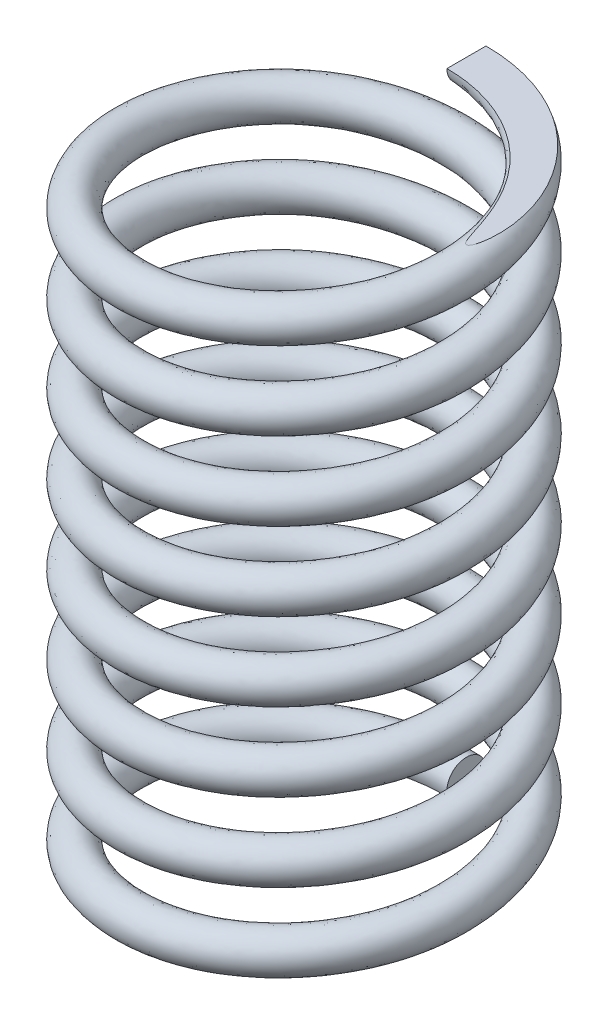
ISO-10303-21;
HEADER;
FILE_DESCRIPTION(('STEP AP214'),'2;1');
FILE_NAME('part.step','',(''),(''),'','','');
FILE_SCHEMA(('AUTOMOTIVE_DESIGN { 1 0 10303 214 1 1 1 1 }'));
ENDSEC;
DATA;
#1=APPLICATION_CONTEXT('core data for automotive mechanical design processes');
#2=APPLICATION_PROTOCOL_DEFINITION('international standard','automotive_design',2000,#1);
#3=PRODUCT_CONTEXT('',#1,'mechanical');
#4=PRODUCT('Part','Part','',(#3));
#5=PRODUCT_RELATED_PRODUCT_CATEGORY('part','',(#4));
#6=PRODUCT_DEFINITION_FORMATION('','',#4);
#7=PRODUCT_DEFINITION_CONTEXT('part definition',#1,'design');
#8=PRODUCT_DEFINITION('design','',#6,#7);
#9=PRODUCT_DEFINITION_SHAPE('','',#8);
#10=(LENGTH_UNIT() NAMED_UNIT(*) SI_UNIT(.MILLI.,.METRE.));
#11=(NAMED_UNIT(*) PLANE_ANGLE_UNIT() SI_UNIT($,.RADIAN.));
#12=(NAMED_UNIT(*) SI_UNIT($,.STERADIAN.) SOLID_ANGLE_UNIT());
#13=UNCERTAINTY_MEASURE_WITH_UNIT(LENGTH_MEASURE(1.E-05),#10,'distance_accuracy_value','');
#14=(GEOMETRIC_REPRESENTATION_CONTEXT(3) GLOBAL_UNCERTAINTY_ASSIGNED_CONTEXT((#13)) GLOBAL_UNIT_ASSIGNED_CONTEXT((#10,
#11,#12)) REPRESENTATION_CONTEXT('',''));
#15=CARTESIAN_POINT('',(0.,0.,0.));
#16=DIRECTION('',(0.,0.,1.));
#17=DIRECTION('',(1.,0.,0.));
#18=AXIS2_PLACEMENT_3D('',#15,#16,#17);
#19=CARTESIAN_POINT('',(0.,0.,-5.4));
#20=DIRECTION('',(1.,0.,0.));
#21=DIRECTION('',(0.,0.,-1.));
#22=AXIS2_PLACEMENT_3D('',#19,#20,#21);
#23=PLANE('',#22);
#24=DIRECTION('',(0.,0.,1.));
#25=VECTOR('',#24,1.);
#26=CARTESIAN_POINT('',(0.,0.,-5.4));
#27=LINE('',#26,#25);
#28=CARTESIAN_POINT('',(0.,0.,-6.05));
#29=VERTEX_POINT('',#28);
#30=CARTESIAN_POINT('',(0.,0.,-4.75));
#31=VERTEX_POINT('',#30);
#32=EDGE_CURVE('E50',#29,#31,#27,.T.);
#33=ORIENTED_EDGE('',*,*,#32,.F.);
#34=CARTESIAN_POINT('',(0.,0.,-5.4));
#35=DIRECTION('',(1.,0.,0.));
#36=DIRECTION('',(0.,0.,-1.));
#37=AXIS2_PLACEMENT_3D('',#34,#35,#36);
#38=CIRCLE('',#37,0.65);
#39=EDGE_CURVE('E76',#31,#29,#38,.T.);
#40=ORIENTED_EDGE('',*,*,#39,.F.);
#41=EDGE_LOOP('',(#33,#40));
#42=FACE_BOUND('',#41,.T.);
#43=ADVANCED_FACE('F32',(#42),#23,.F.);
#44=CARTESIAN_POINT('',(6.03327975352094E-13,-20.8,-5.4));
#45=DIRECTION('',(1.,0.,1.1172740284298E-13));
#46=DIRECTION('',(1.1172740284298E-13,0.,-1.));
#47=AXIS2_PLACEMENT_3D('',#44,#45,#46);
#48=PLANE('',#47);
#49=CARTESIAN_POINT('',(6.03327975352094E-13,-20.8,-5.4));
#50=DIRECTION('',(1.,0.,1.1172740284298E-13));
#51=DIRECTION('',(1.1172740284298E-13,0.,-1.));
#52=AXIS2_PLACEMENT_3D('',#49,#50,#51);
#53=CIRCLE('',#52,0.65);
#54=CARTESIAN_POINT('',(6.75950787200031E-13,-20.8,-6.05));
#55=VERTEX_POINT('',#54);
#56=CARTESIAN_POINT('',(5.33738918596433E-13,-20.9859081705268,-4.77715318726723));
#57=VERTEX_POINT('',#56);
#58=EDGE_CURVE('E69',#55,#57,#53,.T.);
#59=ORIENTED_EDGE('',*,*,#58,.T.);
#60=DIRECTION('',(1.1172740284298E-13,0.,-1.));
#61=VECTOR('',#60,1.);
#62=CARTESIAN_POINT('',(6.03327975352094E-13,-20.9859081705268,-5.4));
#63=LINE('',#62,#61);
#64=CARTESIAN_POINT('',(7.22163946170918E-13,-20.9859081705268,-6.02284681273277));
#65=VERTEX_POINT('',#64);
#66=EDGE_CURVE('E56',#57,#65,#63,.T.);
#67=ORIENTED_EDGE('',*,*,#66,.T.);
#68=EDGE_CURVE('E72',#65,#55,#53,.T.);
#69=ORIENTED_EDGE('',*,*,#68,.T.);
#70=EDGE_LOOP('',(#59,#67,#69));
#71=FACE_BOUND('',#70,.T.);
#72=ADVANCED_FACE('F71',(#71),#48,.T.);
#73=CARTESIAN_POINT('',(0.,0.,-6.05));
#74=CARTESIAN_POINT('',(3.49296912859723,-0.216666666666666,-6.05));
#75=CARTESIAN_POINT('',(5.23945369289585,-0.433333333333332,-3.025));
#76=CARTESIAN_POINT('',(6.98593825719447,-0.649999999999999,0.));
#77=CARTESIAN_POINT('',(5.23945369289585,-0.866666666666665,3.025));
#78=CARTESIAN_POINT('',(3.49296912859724,-1.08333333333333,6.05));
#79=CARTESIAN_POINT('',(0.,-1.3,6.05));
#80=CARTESIAN_POINT('',(-3.49296912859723,-1.51666666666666,6.05));
#81=CARTESIAN_POINT('',(-5.23945369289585,-1.73333333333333,3.025));
#82=CARTESIAN_POINT('',(-6.98593825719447,-1.95,0.));
#83=CARTESIAN_POINT('',(-5.23945369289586,-2.16666666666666,-3.025));
#84=CARTESIAN_POINT('',(-3.49296912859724,-2.38333333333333,-6.05));
#85=CARTESIAN_POINT('',(0.,-2.59999999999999,-6.05));
#86=CARTESIAN_POINT('',(3.49296912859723,-2.81666666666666,-6.05));
#87=CARTESIAN_POINT('',(5.23945369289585,-3.03333333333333,-3.025));
#88=CARTESIAN_POINT('',(6.98593825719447,-3.24999999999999,0.));
#89=CARTESIAN_POINT('',(5.23945369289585,-3.46666666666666,3.025));
#90=CARTESIAN_POINT('',(3.49296912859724,-3.68333333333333,6.05));
#91=CARTESIAN_POINT('',(0.,-3.89999999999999,6.05));
#92=CARTESIAN_POINT('',(-3.49296912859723,-4.11666666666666,6.05));
#93=CARTESIAN_POINT('',(-5.23945369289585,-4.33333333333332,3.025));
#94=CARTESIAN_POINT('',(-6.98593825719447,-4.54999999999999,0.));
#95=CARTESIAN_POINT('',(-5.23945369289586,-4.76666666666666,-3.025));
#96=CARTESIAN_POINT('',(-3.49296912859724,-4.98333333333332,-6.05));
#97=CARTESIAN_POINT('',(0.,-5.19999999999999,-6.05));
#98=CARTESIAN_POINT('',(3.49296912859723,-5.41666666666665,-6.05));
#99=CARTESIAN_POINT('',(5.23945369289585,-5.63333333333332,-3.025));
#100=CARTESIAN_POINT('',(6.98593825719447,-5.84999999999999,0.));
#101=CARTESIAN_POINT('',(5.23945369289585,-6.06666666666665,3.025));
#102=CARTESIAN_POINT('',(3.49296912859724,-6.28333333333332,6.05));
#103=CARTESIAN_POINT('',(0.,-6.49999999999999,6.05));
#104=CARTESIAN_POINT('',(-3.49296912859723,-6.71666666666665,6.05));
#105=CARTESIAN_POINT('',(-5.23945369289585,-6.93333333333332,3.025));
#106=CARTESIAN_POINT('',(-6.98593825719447,-7.14999999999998,0.));
#107=CARTESIAN_POINT('',(-5.23945369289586,-7.36666666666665,-3.025));
#108=CARTESIAN_POINT('',(-3.49296912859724,-7.58333333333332,-6.05));
#109=CARTESIAN_POINT('',(0.,-7.79999999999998,-6.05));
#110=CARTESIAN_POINT('',(3.49296912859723,-8.01666666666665,-6.05));
#111=CARTESIAN_POINT('',(5.23945369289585,-8.23333333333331,-3.025));
#112=CARTESIAN_POINT('',(6.98593825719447,-8.44999999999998,0.));
#113=CARTESIAN_POINT('',(5.23945369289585,-8.66666666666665,3.025));
#114=CARTESIAN_POINT('',(3.49296912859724,-8.88333333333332,6.05));
#115=CARTESIAN_POINT('',(0.,-9.09999999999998,6.05));
#116=CARTESIAN_POINT('',(-3.49296912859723,-9.31666666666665,6.05));
#117=CARTESIAN_POINT('',(-5.23945369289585,-9.53333333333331,3.025));
#118=CARTESIAN_POINT('',(-6.98593825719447,-9.74999999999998,0.));
#119=CARTESIAN_POINT('',(-5.23945369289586,-9.96666666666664,-3.025));
#120=CARTESIAN_POINT('',(-3.49296912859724,-10.1833333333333,-6.05));
#121=CARTESIAN_POINT('',(0.,-10.4,-6.05));
#122=CARTESIAN_POINT('',(3.49296912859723,-10.6166666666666,-6.05));
#123=CARTESIAN_POINT('',(5.23945369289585,-10.8333333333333,-3.025));
#124=CARTESIAN_POINT('',(6.98593825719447,-11.05,0.));
#125=CARTESIAN_POINT('',(5.23945369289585,-11.2666666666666,3.025));
#126=CARTESIAN_POINT('',(3.49296912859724,-11.4833333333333,6.05));
#127=CARTESIAN_POINT('',(0.,-11.7,6.05));
#128=CARTESIAN_POINT('',(-3.49296912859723,-11.9166666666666,6.05));
#129=CARTESIAN_POINT('',(-5.23945369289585,-12.1333333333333,3.025));
#130=CARTESIAN_POINT('',(-6.98593825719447,-12.35,0.));
#131=CARTESIAN_POINT('',(-5.23945369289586,-12.5666666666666,-3.025));
#132=CARTESIAN_POINT('',(-3.49296912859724,-12.7833333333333,-6.05));
#133=CARTESIAN_POINT('',(0.,-13.,-6.05));
#134=CARTESIAN_POINT('',(3.49296912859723,-13.2166666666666,-6.05));
#135=CARTESIAN_POINT('',(5.23945369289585,-13.4333333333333,-3.025));
#136=CARTESIAN_POINT('',(6.98593825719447,-13.65,0.));
#137=CARTESIAN_POINT('',(5.23945369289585,-13.8666666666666,3.025));
#138=CARTESIAN_POINT('',(3.49296912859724,-14.0833333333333,6.05));
#139=CARTESIAN_POINT('',(0.,-14.3,6.05));
#140=CARTESIAN_POINT('',(-3.49296912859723,-14.5166666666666,6.05));
#141=CARTESIAN_POINT('',(-5.23945369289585,-14.7333333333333,3.025));
#142=CARTESIAN_POINT('',(-6.98593825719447,-14.95,0.));
#143=CARTESIAN_POINT('',(-5.23945369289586,-15.1666666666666,-3.025));
#144=CARTESIAN_POINT('',(-3.49296912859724,-15.3833333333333,-6.05));
#145=CARTESIAN_POINT('',(0.,-15.6,-6.05));
#146=CARTESIAN_POINT('',(3.49296912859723,-15.8166666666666,-6.05));
#147=CARTESIAN_POINT('',(5.23945369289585,-16.0333333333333,-3.025));
#148=CARTESIAN_POINT('',(6.98593825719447,-16.25,0.));
#149=CARTESIAN_POINT('',(5.23945369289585,-16.4666666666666,3.025));
#150=CARTESIAN_POINT('',(3.49296912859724,-16.6833333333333,6.05));
#151=CARTESIAN_POINT('',(0.,-16.9,6.05));
#152=CARTESIAN_POINT('',(-3.49296912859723,-17.1166666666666,6.05));
#153=CARTESIAN_POINT('',(-5.23945369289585,-17.3333333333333,3.025));
#154=CARTESIAN_POINT('',(-6.98593825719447,-17.55,0.));
#155=CARTESIAN_POINT('',(-5.23945369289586,-17.7666666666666,-3.025));
#156=CARTESIAN_POINT('',(-3.49296912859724,-17.9833333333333,-6.05));
#157=CARTESIAN_POINT('',(0.,-18.2,-6.05));
#158=CARTESIAN_POINT('',(3.49296912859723,-18.4166666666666,-6.05));
#159=CARTESIAN_POINT('',(5.23945369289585,-18.6333333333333,-3.025));
#160=CARTESIAN_POINT('',(6.98593825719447,-18.85,0.));
#161=CARTESIAN_POINT('',(5.23945369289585,-19.0666666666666,3.025));
#162=CARTESIAN_POINT('',(3.49296912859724,-19.2833333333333,6.05));
#163=CARTESIAN_POINT('',(0.,-19.5,6.05));
#164=CARTESIAN_POINT('',(-3.49296912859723,-19.7166666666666,6.05));
#165=CARTESIAN_POINT('',(-5.23945369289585,-19.9333333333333,3.025));
#166=CARTESIAN_POINT('',(-6.98593825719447,-20.15,0.));
#167=CARTESIAN_POINT('',(-5.23945369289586,-20.3666666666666,-3.025));
#168=CARTESIAN_POINT('',(-3.49296912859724,-20.5833333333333,-6.05));
#169=CARTESIAN_POINT('',(0.,-20.8,-6.05));
#170=CARTESIAN_POINT('',(3.49296912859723,-21.0166666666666,-6.05));
#171=CARTESIAN_POINT('',(5.23945369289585,-21.2333333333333,-3.025));
#172=CARTESIAN_POINT('',(6.98593825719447,-21.45,0.));
#173=CARTESIAN_POINT('',(5.23945369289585,-21.6666666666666,3.025));
#174=CARTESIAN_POINT('',(3.49296912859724,-21.8833333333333,6.05));
#175=CARTESIAN_POINT('',(0.,-22.1,6.05));
#176=CARTESIAN_POINT('',(-3.49296912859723,-22.3166666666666,6.05));
#177=CARTESIAN_POINT('',(-5.23945369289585,-22.5333333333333,3.025));
#178=CARTESIAN_POINT('',(-6.98593825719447,-22.75,0.));
#179=CARTESIAN_POINT('',(-5.23945369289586,-22.9666666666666,-3.025));
#180=CARTESIAN_POINT('',(-3.49296912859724,-23.1833333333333,-6.05));
#181=CARTESIAN_POINT('',(0.,-23.3999999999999,-6.05));
#182=CARTESIAN_POINT('',(0.,1.3,-6.05));
#183=CARTESIAN_POINT('',(3.49296912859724,1.08333333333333,-6.05));
#184=CARTESIAN_POINT('',(5.23945369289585,0.866666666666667,-3.025));
#185=CARTESIAN_POINT('',(6.98593825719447,0.650000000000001,0.));
#186=CARTESIAN_POINT('',(5.23945369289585,0.433333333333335,3.025));
#187=CARTESIAN_POINT('',(3.49296912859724,0.216666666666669,6.05));
#188=CARTESIAN_POINT('',(0.,0.,6.05));
#189=CARTESIAN_POINT('',(-3.49296912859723,-0.216666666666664,6.05));
#190=CARTESIAN_POINT('',(-5.23945369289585,-0.43333333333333,3.025));
#191=CARTESIAN_POINT('',(-6.98593825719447,-0.649999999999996,0.));
#192=CARTESIAN_POINT('',(-5.23945369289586,-0.866666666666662,-3.025));
#193=CARTESIAN_POINT('',(-3.49296912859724,-1.08333333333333,-6.05));
#194=CARTESIAN_POINT('',(0.,-1.29999999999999,-6.05));
#195=CARTESIAN_POINT('',(3.49296912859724,-1.51666666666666,-6.05));
#196=CARTESIAN_POINT('',(5.23945369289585,-1.73333333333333,-3.025));
#197=CARTESIAN_POINT('',(6.98593825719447,-1.94999999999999,0.));
#198=CARTESIAN_POINT('',(5.23945369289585,-2.16666666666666,3.025));
#199=CARTESIAN_POINT('',(3.49296912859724,-2.38333333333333,6.05));
#200=CARTESIAN_POINT('',(0.,-2.59999999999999,6.05));
#201=CARTESIAN_POINT('',(-3.49296912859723,-2.81666666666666,6.05));
#202=CARTESIAN_POINT('',(-5.23945369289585,-3.03333333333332,3.025));
#203=CARTESIAN_POINT('',(-6.98593825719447,-3.24999999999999,0.));
#204=CARTESIAN_POINT('',(-5.23945369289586,-3.46666666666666,-3.025));
#205=CARTESIAN_POINT('',(-3.49296912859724,-3.68333333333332,-6.05));
#206=CARTESIAN_POINT('',(0.,-3.89999999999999,-6.05));
#207=CARTESIAN_POINT('',(3.49296912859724,-4.11666666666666,-6.05));
#208=CARTESIAN_POINT('',(5.23945369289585,-4.33333333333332,-3.025));
#209=CARTESIAN_POINT('',(6.98593825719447,-4.54999999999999,0.));
#210=CARTESIAN_POINT('',(5.23945369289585,-4.76666666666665,3.025));
#211=CARTESIAN_POINT('',(3.49296912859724,-4.98333333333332,6.05));
#212=CARTESIAN_POINT('',(0.,-5.19999999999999,6.05));
#213=CARTESIAN_POINT('',(-3.49296912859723,-5.41666666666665,6.05));
#214=CARTESIAN_POINT('',(-5.23945369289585,-5.63333333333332,3.025));
#215=CARTESIAN_POINT('',(-6.98593825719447,-5.84999999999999,0.));
#216=CARTESIAN_POINT('',(-5.23945369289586,-6.06666666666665,-3.025));
#217=CARTESIAN_POINT('',(-3.49296912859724,-6.28333333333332,-6.05));
#218=CARTESIAN_POINT('',(0.,-6.49999999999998,-6.05));
#219=CARTESIAN_POINT('',(3.49296912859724,-6.71666666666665,-6.05));
#220=CARTESIAN_POINT('',(5.23945369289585,-6.93333333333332,-3.025));
#221=CARTESIAN_POINT('',(6.98593825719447,-7.14999999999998,0.));
#222=CARTESIAN_POINT('',(5.23945369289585,-7.36666666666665,3.025));
#223=CARTESIAN_POINT('',(3.49296912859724,-7.58333333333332,6.05));
#224=CARTESIAN_POINT('',(0.,-7.79999999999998,6.05));
#225=CARTESIAN_POINT('',(-3.49296912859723,-8.01666666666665,6.05));
#226=CARTESIAN_POINT('',(-5.23945369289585,-8.23333333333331,3.025));
#227=CARTESIAN_POINT('',(-6.98593825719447,-8.44999999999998,0.));
#228=CARTESIAN_POINT('',(-5.23945369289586,-8.66666666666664,-3.025));
#229=CARTESIAN_POINT('',(-3.49296912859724,-8.88333333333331,-6.05));
#230=CARTESIAN_POINT('',(0.,-9.09999999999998,-6.05));
#231=CARTESIAN_POINT('',(3.49296912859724,-9.31666666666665,-6.05));
#232=CARTESIAN_POINT('',(5.23945369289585,-9.53333333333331,-3.025));
#233=CARTESIAN_POINT('',(6.98593825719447,-9.74999999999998,0.));
#234=CARTESIAN_POINT('',(5.23945369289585,-9.96666666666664,3.025));
#235=CARTESIAN_POINT('',(3.49296912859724,-10.1833333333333,6.05));
#236=CARTESIAN_POINT('',(0.,-10.4,6.05));
#237=CARTESIAN_POINT('',(-3.49296912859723,-10.6166666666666,6.05));
#238=CARTESIAN_POINT('',(-5.23945369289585,-10.8333333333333,3.025));
#239=CARTESIAN_POINT('',(-6.98593825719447,-11.05,0.));
#240=CARTESIAN_POINT('',(-5.23945369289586,-11.2666666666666,-3.025));
#241=CARTESIAN_POINT('',(-3.49296912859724,-11.4833333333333,-6.05));
#242=CARTESIAN_POINT('',(0.,-11.7,-6.05));
#243=CARTESIAN_POINT('',(3.49296912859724,-11.9166666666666,-6.05));
#244=CARTESIAN_POINT('',(5.23945369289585,-12.1333333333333,-3.025));
#245=CARTESIAN_POINT('',(6.98593825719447,-12.35,0.));
#246=CARTESIAN_POINT('',(5.23945369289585,-12.5666666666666,3.025));
#247=CARTESIAN_POINT('',(3.49296912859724,-12.7833333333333,6.05));
#248=CARTESIAN_POINT('',(0.,-13.,6.05));
#249=CARTESIAN_POINT('',(-3.49296912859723,-13.2166666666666,6.05));
#250=CARTESIAN_POINT('',(-5.23945369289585,-13.4333333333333,3.025));
#251=CARTESIAN_POINT('',(-6.98593825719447,-13.65,0.));
#252=CARTESIAN_POINT('',(-5.23945369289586,-13.8666666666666,-3.025));
#253=CARTESIAN_POINT('',(-3.49296912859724,-14.0833333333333,-6.05));
#254=CARTESIAN_POINT('',(0.,-14.3,-6.05));
#255=CARTESIAN_POINT('',(3.49296912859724,-14.5166666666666,-6.05));
#256=CARTESIAN_POINT('',(5.23945369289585,-14.7333333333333,-3.025));
#257=CARTESIAN_POINT('',(6.98593825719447,-14.95,0.));
#258=CARTESIAN_POINT('',(5.23945369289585,-15.1666666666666,3.025));
#259=CARTESIAN_POINT('',(3.49296912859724,-15.3833333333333,6.05));
#260=CARTESIAN_POINT('',(0.,-15.6,6.05));
#261=CARTESIAN_POINT('',(-3.49296912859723,-15.8166666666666,6.05));
#262=CARTESIAN_POINT('',(-5.23945369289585,-16.0333333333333,3.025));
#263=CARTESIAN_POINT('',(-6.98593825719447,-16.25,0.));
#264=CARTESIAN_POINT('',(-5.23945369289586,-16.4666666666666,-3.025));
#265=CARTESIAN_POINT('',(-3.49296912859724,-16.6833333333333,-6.05));
#266=CARTESIAN_POINT('',(0.,-16.9,-6.05));
#267=CARTESIAN_POINT('',(3.49296912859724,-17.1166666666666,-6.05));
#268=CARTESIAN_POINT('',(5.23945369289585,-17.3333333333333,-3.025));
#269=CARTESIAN_POINT('',(6.98593825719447,-17.55,0.));
#270=CARTESIAN_POINT('',(5.23945369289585,-17.7666666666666,3.025));
#271=CARTESIAN_POINT('',(3.49296912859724,-17.9833333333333,6.05));
#272=CARTESIAN_POINT('',(0.,-18.2,6.05));
#273=CARTESIAN_POINT('',(-3.49296912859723,-18.4166666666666,6.05));
#274=CARTESIAN_POINT('',(-5.23945369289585,-18.6333333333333,3.025));
#275=CARTESIAN_POINT('',(-6.98593825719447,-18.85,0.));
#276=CARTESIAN_POINT('',(-5.23945369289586,-19.0666666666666,-3.025));
#277=CARTESIAN_POINT('',(-3.49296912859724,-19.2833333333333,-6.05));
#278=CARTESIAN_POINT('',(0.,-19.5,-6.05));
#279=CARTESIAN_POINT('',(3.49296912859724,-19.7166666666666,-6.05));
#280=CARTESIAN_POINT('',(5.23945369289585,-19.9333333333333,-3.025));
#281=CARTESIAN_POINT('',(6.98593825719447,-20.15,0.));
#282=CARTESIAN_POINT('',(5.23945369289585,-20.3666666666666,3.025));
#283=CARTESIAN_POINT('',(3.49296912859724,-20.5833333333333,6.05));
#284=CARTESIAN_POINT('',(0.,-20.8,6.05));
#285=CARTESIAN_POINT('',(-3.49296912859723,-21.0166666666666,6.05));
#286=CARTESIAN_POINT('',(-5.23945369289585,-21.2333333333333,3.025));
#287=CARTESIAN_POINT('',(-6.98593825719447,-21.45,0.));
#288=CARTESIAN_POINT('',(-5.23945369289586,-21.6666666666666,-3.025));
#289=CARTESIAN_POINT('',(-3.49296912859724,-21.8833333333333,-6.05));
#290=CARTESIAN_POINT('',(0.,-22.0999999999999,-6.05));
#291=CARTESIAN_POINT('',(0.,1.3,-4.75));
#292=CARTESIAN_POINT('',(2.74241377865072,1.08333333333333,-4.75));
#293=CARTESIAN_POINT('',(4.11362066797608,0.866666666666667,-2.375));
#294=CARTESIAN_POINT('',(5.48482755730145,0.650000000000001,0.));
#295=CARTESIAN_POINT('',(4.11362066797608,0.433333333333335,2.375));
#296=CARTESIAN_POINT('',(2.74241377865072,0.216666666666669,4.75));
#297=CARTESIAN_POINT('',(0.,0.,4.75));
#298=CARTESIAN_POINT('',(-2.74241377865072,-0.216666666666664,4.75));
#299=CARTESIAN_POINT('',(-4.11362066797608,-0.43333333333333,2.375));
#300=CARTESIAN_POINT('',(-5.48482755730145,-0.649999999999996,0.));
#301=CARTESIAN_POINT('',(-4.11362066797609,-0.866666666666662,-2.375));
#302=CARTESIAN_POINT('',(-2.74241377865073,-1.08333333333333,-4.75));
#303=CARTESIAN_POINT('',(0.,-1.29999999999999,-4.75));
#304=CARTESIAN_POINT('',(2.74241377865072,-1.51666666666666,-4.75));
#305=CARTESIAN_POINT('',(4.11362066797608,-1.73333333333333,-2.375));
#306=CARTESIAN_POINT('',(5.48482755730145,-1.94999999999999,0.));
#307=CARTESIAN_POINT('',(4.11362066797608,-2.16666666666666,2.375));
#308=CARTESIAN_POINT('',(2.74241377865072,-2.38333333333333,4.75));
#309=CARTESIAN_POINT('',(0.,-2.59999999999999,4.75));
#310=CARTESIAN_POINT('',(-2.74241377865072,-2.81666666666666,4.75));
#311=CARTESIAN_POINT('',(-4.11362066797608,-3.03333333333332,2.375));
#312=CARTESIAN_POINT('',(-5.48482755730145,-3.24999999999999,0.));
#313=CARTESIAN_POINT('',(-4.11362066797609,-3.46666666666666,-2.375));
#314=CARTESIAN_POINT('',(-2.74241377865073,-3.68333333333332,-4.75));
#315=CARTESIAN_POINT('',(0.,-3.89999999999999,-4.75));
#316=CARTESIAN_POINT('',(2.74241377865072,-4.11666666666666,-4.75));
#317=CARTESIAN_POINT('',(4.11362066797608,-4.33333333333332,-2.375));
#318=CARTESIAN_POINT('',(5.48482755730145,-4.54999999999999,0.));
#319=CARTESIAN_POINT('',(4.11362066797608,-4.76666666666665,2.375));
#320=CARTESIAN_POINT('',(2.74241377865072,-4.98333333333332,4.75));
#321=CARTESIAN_POINT('',(0.,-5.19999999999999,4.75));
#322=CARTESIAN_POINT('',(-2.74241377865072,-5.41666666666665,4.75));
#323=CARTESIAN_POINT('',(-4.11362066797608,-5.63333333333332,2.375));
#324=CARTESIAN_POINT('',(-5.48482755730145,-5.84999999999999,0.));
#325=CARTESIAN_POINT('',(-4.11362066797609,-6.06666666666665,-2.375));
#326=CARTESIAN_POINT('',(-2.74241377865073,-6.28333333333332,-4.75));
#327=CARTESIAN_POINT('',(0.,-6.49999999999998,-4.75));
#328=CARTESIAN_POINT('',(2.74241377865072,-6.71666666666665,-4.75));
#329=CARTESIAN_POINT('',(4.11362066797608,-6.93333333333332,-2.375));
#330=CARTESIAN_POINT('',(5.48482755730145,-7.14999999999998,0.));
#331=CARTESIAN_POINT('',(4.11362066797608,-7.36666666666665,2.375));
#332=CARTESIAN_POINT('',(2.74241377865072,-7.58333333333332,4.75));
#333=CARTESIAN_POINT('',(0.,-7.79999999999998,4.75));
#334=CARTESIAN_POINT('',(-2.74241377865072,-8.01666666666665,4.75));
#335=CARTESIAN_POINT('',(-4.11362066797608,-8.23333333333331,2.375));
#336=CARTESIAN_POINT('',(-5.48482755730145,-8.44999999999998,0.));
#337=CARTESIAN_POINT('',(-4.11362066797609,-8.66666666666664,-2.375));
#338=CARTESIAN_POINT('',(-2.74241377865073,-8.88333333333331,-4.75));
#339=CARTESIAN_POINT('',(0.,-9.09999999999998,-4.75));
#340=CARTESIAN_POINT('',(2.74241377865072,-9.31666666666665,-4.75));
#341=CARTESIAN_POINT('',(4.11362066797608,-9.53333333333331,-2.375));
#342=CARTESIAN_POINT('',(5.48482755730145,-9.74999999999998,0.));
#343=CARTESIAN_POINT('',(4.11362066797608,-9.96666666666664,2.375));
#344=CARTESIAN_POINT('',(2.74241377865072,-10.1833333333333,4.75));
#345=CARTESIAN_POINT('',(0.,-10.4,4.75));
#346=CARTESIAN_POINT('',(-2.74241377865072,-10.6166666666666,4.75));
#347=CARTESIAN_POINT('',(-4.11362066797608,-10.8333333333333,2.375));
#348=CARTESIAN_POINT('',(-5.48482755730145,-11.05,0.));
#349=CARTESIAN_POINT('',(-4.11362066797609,-11.2666666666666,-2.375));
#350=CARTESIAN_POINT('',(-2.74241377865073,-11.4833333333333,-4.75));
#351=CARTESIAN_POINT('',(0.,-11.7,-4.75));
#352=CARTESIAN_POINT('',(2.74241377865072,-11.9166666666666,-4.75));
#353=CARTESIAN_POINT('',(4.11362066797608,-12.1333333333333,-2.375));
#354=CARTESIAN_POINT('',(5.48482755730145,-12.35,0.));
#355=CARTESIAN_POINT('',(4.11362066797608,-12.5666666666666,2.375));
#356=CARTESIAN_POINT('',(2.74241377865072,-12.7833333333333,4.75));
#357=CARTESIAN_POINT('',(0.,-13.,4.75));
#358=CARTESIAN_POINT('',(-2.74241377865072,-13.2166666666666,4.75));
#359=CARTESIAN_POINT('',(-4.11362066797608,-13.4333333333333,2.375));
#360=CARTESIAN_POINT('',(-5.48482755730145,-13.65,0.));
#361=CARTESIAN_POINT('',(-4.11362066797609,-13.8666666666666,-2.375));
#362=CARTESIAN_POINT('',(-2.74241377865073,-14.0833333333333,-4.75));
#363=CARTESIAN_POINT('',(0.,-14.3,-4.75));
#364=CARTESIAN_POINT('',(2.74241377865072,-14.5166666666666,-4.75));
#365=CARTESIAN_POINT('',(4.11362066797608,-14.7333333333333,-2.375));
#366=CARTESIAN_POINT('',(5.48482755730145,-14.95,0.));
#367=CARTESIAN_POINT('',(4.11362066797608,-15.1666666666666,2.375));
#368=CARTESIAN_POINT('',(2.74241377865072,-15.3833333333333,4.75));
#369=CARTESIAN_POINT('',(0.,-15.6,4.75));
#370=CARTESIAN_POINT('',(-2.74241377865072,-15.8166666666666,4.75));
#371=CARTESIAN_POINT('',(-4.11362066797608,-16.0333333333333,2.375));
#372=CARTESIAN_POINT('',(-5.48482755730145,-16.25,0.));
#373=CARTESIAN_POINT('',(-4.11362066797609,-16.4666666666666,-2.375));
#374=CARTESIAN_POINT('',(-2.74241377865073,-16.6833333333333,-4.75));
#375=CARTESIAN_POINT('',(0.,-16.9,-4.75));
#376=CARTESIAN_POINT('',(2.74241377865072,-17.1166666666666,-4.75));
#377=CARTESIAN_POINT('',(4.11362066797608,-17.3333333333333,-2.375));
#378=CARTESIAN_POINT('',(5.48482755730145,-17.55,0.));
#379=CARTESIAN_POINT('',(4.11362066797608,-17.7666666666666,2.375));
#380=CARTESIAN_POINT('',(2.74241377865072,-17.9833333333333,4.75));
#381=CARTESIAN_POINT('',(0.,-18.2,4.75));
#382=CARTESIAN_POINT('',(-2.74241377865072,-18.4166666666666,4.75));
#383=CARTESIAN_POINT('',(-4.11362066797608,-18.6333333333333,2.375));
#384=CARTESIAN_POINT('',(-5.48482755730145,-18.85,0.));
#385=CARTESIAN_POINT('',(-4.11362066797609,-19.0666666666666,-2.375));
#386=CARTESIAN_POINT('',(-2.74241377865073,-19.2833333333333,-4.75));
#387=CARTESIAN_POINT('',(0.,-19.5,-4.75));
#388=CARTESIAN_POINT('',(2.74241377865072,-19.7166666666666,-4.75));
#389=CARTESIAN_POINT('',(4.11362066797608,-19.9333333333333,-2.375));
#390=CARTESIAN_POINT('',(5.48482755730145,-20.15,0.));
#391=CARTESIAN_POINT('',(4.11362066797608,-20.3666666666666,2.375));
#392=CARTESIAN_POINT('',(2.74241377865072,-20.5833333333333,4.75));
#393=CARTESIAN_POINT('',(0.,-20.8,4.75));
#394=CARTESIAN_POINT('',(-2.74241377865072,-21.0166666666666,4.75));
#395=CARTESIAN_POINT('',(-4.11362066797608,-21.2333333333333,2.375));
#396=CARTESIAN_POINT('',(-5.48482755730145,-21.45,0.));
#397=CARTESIAN_POINT('',(-4.11362066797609,-21.6666666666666,-2.375));
#398=CARTESIAN_POINT('',(-2.74241377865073,-21.8833333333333,-4.75));
#399=CARTESIAN_POINT('',(0.,-22.0999999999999,-4.75));
#400=CARTESIAN_POINT('',(0.,0.,-4.75));
#401=CARTESIAN_POINT('',(2.74241377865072,-0.216666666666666,-4.75));
#402=CARTESIAN_POINT('',(4.11362066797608,-0.433333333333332,-2.375));
#403=CARTESIAN_POINT('',(5.48482755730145,-0.649999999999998,0.));
#404=CARTESIAN_POINT('',(4.11362066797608,-0.866666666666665,2.375));
#405=CARTESIAN_POINT('',(2.74241377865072,-1.08333333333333,4.75));
#406=CARTESIAN_POINT('',(0.,-1.3,4.75));
#407=CARTESIAN_POINT('',(-2.74241377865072,-1.51666666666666,4.75));
#408=CARTESIAN_POINT('',(-4.11362066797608,-1.73333333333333,2.375));
#409=CARTESIAN_POINT('',(-5.48482755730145,-1.95,0.));
#410=CARTESIAN_POINT('',(-4.11362066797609,-2.16666666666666,-2.375));
#411=CARTESIAN_POINT('',(-2.74241377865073,-2.38333333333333,-4.75));
#412=CARTESIAN_POINT('',(0.,-2.59999999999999,-4.75));
#413=CARTESIAN_POINT('',(2.74241377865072,-2.81666666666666,-4.75));
#414=CARTESIAN_POINT('',(4.11362066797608,-3.03333333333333,-2.375));
#415=CARTESIAN_POINT('',(5.48482755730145,-3.24999999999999,0.));
#416=CARTESIAN_POINT('',(4.11362066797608,-3.46666666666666,2.375));
#417=CARTESIAN_POINT('',(2.74241377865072,-3.68333333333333,4.75));
#418=CARTESIAN_POINT('',(0.,-3.89999999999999,4.75));
#419=CARTESIAN_POINT('',(-2.74241377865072,-4.11666666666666,4.75));
#420=CARTESIAN_POINT('',(-4.11362066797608,-4.33333333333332,2.375));
#421=CARTESIAN_POINT('',(-5.48482755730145,-4.54999999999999,0.));
#422=CARTESIAN_POINT('',(-4.11362066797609,-4.76666666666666,-2.375));
#423=CARTESIAN_POINT('',(-2.74241377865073,-4.98333333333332,-4.75));
#424=CARTESIAN_POINT('',(0.,-5.19999999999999,-4.75));
#425=CARTESIAN_POINT('',(2.74241377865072,-5.41666666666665,-4.75));
#426=CARTESIAN_POINT('',(4.11362066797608,-5.63333333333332,-2.375));
#427=CARTESIAN_POINT('',(5.48482755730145,-5.84999999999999,0.));
#428=CARTESIAN_POINT('',(4.11362066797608,-6.06666666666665,2.375));
#429=CARTESIAN_POINT('',(2.74241377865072,-6.28333333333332,4.75));
#430=CARTESIAN_POINT('',(0.,-6.49999999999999,4.75));
#431=CARTESIAN_POINT('',(-2.74241377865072,-6.71666666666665,4.75));
#432=CARTESIAN_POINT('',(-4.11362066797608,-6.93333333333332,2.375));
#433=CARTESIAN_POINT('',(-5.48482755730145,-7.14999999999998,0.));
#434=CARTESIAN_POINT('',(-4.11362066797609,-7.36666666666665,-2.375));
#435=CARTESIAN_POINT('',(-2.74241377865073,-7.58333333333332,-4.75));
#436=CARTESIAN_POINT('',(0.,-7.79999999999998,-4.75));
#437=CARTESIAN_POINT('',(2.74241377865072,-8.01666666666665,-4.75));
#438=CARTESIAN_POINT('',(4.11362066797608,-8.23333333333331,-2.375));
#439=CARTESIAN_POINT('',(5.48482755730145,-8.44999999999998,0.));
#440=CARTESIAN_POINT('',(4.11362066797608,-8.66666666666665,2.375));
#441=CARTESIAN_POINT('',(2.74241377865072,-8.88333333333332,4.75));
#442=CARTESIAN_POINT('',(0.,-9.09999999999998,4.75));
#443=CARTESIAN_POINT('',(-2.74241377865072,-9.31666666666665,4.75));
#444=CARTESIAN_POINT('',(-4.11362066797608,-9.53333333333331,2.375));
#445=CARTESIAN_POINT('',(-5.48482755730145,-9.74999999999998,0.));
#446=CARTESIAN_POINT('',(-4.11362066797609,-9.96666666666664,-2.375));
#447=CARTESIAN_POINT('',(-2.74241377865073,-10.1833333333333,-4.75));
#448=CARTESIAN_POINT('',(0.,-10.4,-4.75));
#449=CARTESIAN_POINT('',(2.74241377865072,-10.6166666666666,-4.75));
#450=CARTESIAN_POINT('',(4.11362066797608,-10.8333333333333,-2.375));
#451=CARTESIAN_POINT('',(5.48482755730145,-11.05,0.));
#452=CARTESIAN_POINT('',(4.11362066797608,-11.2666666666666,2.375));
#453=CARTESIAN_POINT('',(2.74241377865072,-11.4833333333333,4.75));
#454=CARTESIAN_POINT('',(0.,-11.7,4.75));
#455=CARTESIAN_POINT('',(-2.74241377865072,-11.9166666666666,4.75));
#456=CARTESIAN_POINT('',(-4.11362066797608,-12.1333333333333,2.375));
#457=CARTESIAN_POINT('',(-5.48482755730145,-12.35,0.));
#458=CARTESIAN_POINT('',(-4.11362066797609,-12.5666666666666,-2.375));
#459=CARTESIAN_POINT('',(-2.74241377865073,-12.7833333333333,-4.75));
#460=CARTESIAN_POINT('',(0.,-13.,-4.75));
#461=CARTESIAN_POINT('',(2.74241377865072,-13.2166666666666,-4.75));
#462=CARTESIAN_POINT('',(4.11362066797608,-13.4333333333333,-2.375));
#463=CARTESIAN_POINT('',(5.48482755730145,-13.65,0.));
#464=CARTESIAN_POINT('',(4.11362066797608,-13.8666666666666,2.375));
#465=CARTESIAN_POINT('',(2.74241377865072,-14.0833333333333,4.75));
#466=CARTESIAN_POINT('',(0.,-14.3,4.75));
#467=CARTESIAN_POINT('',(-2.74241377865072,-14.5166666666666,4.75));
#468=CARTESIAN_POINT('',(-4.11362066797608,-14.7333333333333,2.375));
#469=CARTESIAN_POINT('',(-5.48482755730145,-14.95,0.));
#470=CARTESIAN_POINT('',(-4.11362066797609,-15.1666666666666,-2.375));
#471=CARTESIAN_POINT('',(-2.74241377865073,-15.3833333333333,-4.75));
#472=CARTESIAN_POINT('',(0.,-15.6,-4.75));
#473=CARTESIAN_POINT('',(2.74241377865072,-15.8166666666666,-4.75));
#474=CARTESIAN_POINT('',(4.11362066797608,-16.0333333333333,-2.375));
#475=CARTESIAN_POINT('',(5.48482755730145,-16.25,0.));
#476=CARTESIAN_POINT('',(4.11362066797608,-16.4666666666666,2.375));
#477=CARTESIAN_POINT('',(2.74241377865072,-16.6833333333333,4.75));
#478=CARTESIAN_POINT('',(0.,-16.9,4.75));
#479=CARTESIAN_POINT('',(-2.74241377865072,-17.1166666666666,4.75));
#480=CARTESIAN_POINT('',(-4.11362066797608,-17.3333333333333,2.375));
#481=CARTESIAN_POINT('',(-5.48482755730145,-17.55,0.));
#482=CARTESIAN_POINT('',(-4.11362066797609,-17.7666666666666,-2.375));
#483=CARTESIAN_POINT('',(-2.74241377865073,-17.9833333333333,-4.75));
#484=CARTESIAN_POINT('',(0.,-18.2,-4.75));
#485=CARTESIAN_POINT('',(2.74241377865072,-18.4166666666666,-4.75));
#486=CARTESIAN_POINT('',(4.11362066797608,-18.6333333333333,-2.375));
#487=CARTESIAN_POINT('',(5.48482755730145,-18.85,0.));
#488=CARTESIAN_POINT('',(4.11362066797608,-19.0666666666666,2.375));
#489=CARTESIAN_POINT('',(2.74241377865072,-19.2833333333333,4.75));
#490=CARTESIAN_POINT('',(0.,-19.5,4.75));
#491=CARTESIAN_POINT('',(-2.74241377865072,-19.7166666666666,4.75));
#492=CARTESIAN_POINT('',(-4.11362066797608,-19.9333333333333,2.375));
#493=CARTESIAN_POINT('',(-5.48482755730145,-20.15,0.));
#494=CARTESIAN_POINT('',(-4.11362066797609,-20.3666666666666,-2.375));
#495=CARTESIAN_POINT('',(-2.74241377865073,-20.5833333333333,-4.75));
#496=CARTESIAN_POINT('',(0.,-20.8,-4.75));
#497=CARTESIAN_POINT('',(2.74241377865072,-21.0166666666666,-4.75));
#498=CARTESIAN_POINT('',(4.11362066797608,-21.2333333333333,-2.375));
#499=CARTESIAN_POINT('',(5.48482755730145,-21.45,0.));
#500=CARTESIAN_POINT('',(4.11362066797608,-21.6666666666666,2.375));
#501=CARTESIAN_POINT('',(2.74241377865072,-21.8833333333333,4.75));
#502=CARTESIAN_POINT('',(0.,-22.1,4.75));
#503=CARTESIAN_POINT('',(-2.74241377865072,-22.3166666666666,4.75));
#504=CARTESIAN_POINT('',(-4.11362066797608,-22.5333333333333,2.375));
#505=CARTESIAN_POINT('',(-5.48482755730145,-22.75,0.));
#506=CARTESIAN_POINT('',(-4.11362066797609,-22.9666666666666,-2.375));
#507=CARTESIAN_POINT('',(-2.74241377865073,-23.1833333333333,-4.75));
#508=CARTESIAN_POINT('',(0.,-23.3999999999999,-4.75));
#509=CARTESIAN_POINT('',(0.,-1.3,-4.75));
#510=CARTESIAN_POINT('',(2.74241377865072,-1.51666666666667,-4.75));
#511=CARTESIAN_POINT('',(4.11362066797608,-1.73333333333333,-2.375));
#512=CARTESIAN_POINT('',(5.48482755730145,-1.95,0.));
#513=CARTESIAN_POINT('',(4.11362066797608,-2.16666666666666,2.375));
#514=CARTESIAN_POINT('',(2.74241377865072,-2.38333333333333,4.75));
#515=CARTESIAN_POINT('',(0.,-2.6,4.75));
#516=CARTESIAN_POINT('',(-2.74241377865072,-2.81666666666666,4.75));
#517=CARTESIAN_POINT('',(-4.11362066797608,-3.03333333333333,2.375));
#518=CARTESIAN_POINT('',(-5.48482755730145,-3.25,0.));
#519=CARTESIAN_POINT('',(-4.11362066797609,-3.46666666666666,-2.375));
#520=CARTESIAN_POINT('',(-2.74241377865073,-3.68333333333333,-4.75));
#521=CARTESIAN_POINT('',(0.,-3.89999999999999,-4.75));
#522=CARTESIAN_POINT('',(2.74241377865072,-4.11666666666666,-4.75));
#523=CARTESIAN_POINT('',(4.11362066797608,-4.33333333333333,-2.375));
#524=CARTESIAN_POINT('',(5.48482755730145,-4.54999999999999,0.));
#525=CARTESIAN_POINT('',(4.11362066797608,-4.76666666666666,2.375));
#526=CARTESIAN_POINT('',(2.74241377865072,-4.98333333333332,4.75));
#527=CARTESIAN_POINT('',(0.,-5.19999999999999,4.75));
#528=CARTESIAN_POINT('',(-2.74241377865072,-5.41666666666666,4.75));
#529=CARTESIAN_POINT('',(-4.11362066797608,-5.63333333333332,2.375));
#530=CARTESIAN_POINT('',(-5.48482755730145,-5.84999999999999,0.));
#531=CARTESIAN_POINT('',(-4.11362066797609,-6.06666666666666,-2.375));
#532=CARTESIAN_POINT('',(-2.74241377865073,-6.28333333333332,-4.75));
#533=CARTESIAN_POINT('',(0.,-6.49999999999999,-4.75));
#534=CARTESIAN_POINT('',(2.74241377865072,-6.71666666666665,-4.75));
#535=CARTESIAN_POINT('',(4.11362066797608,-6.93333333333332,-2.375));
#536=CARTESIAN_POINT('',(5.48482755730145,-7.14999999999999,0.));
#537=CARTESIAN_POINT('',(4.11362066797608,-7.36666666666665,2.375));
#538=CARTESIAN_POINT('',(2.74241377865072,-7.58333333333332,4.75));
#539=CARTESIAN_POINT('',(0.,-7.79999999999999,4.75));
#540=CARTESIAN_POINT('',(-2.74241377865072,-8.01666666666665,4.75));
#541=CARTESIAN_POINT('',(-4.11362066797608,-8.23333333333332,2.375));
#542=CARTESIAN_POINT('',(-5.48482755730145,-8.44999999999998,0.));
#543=CARTESIAN_POINT('',(-4.11362066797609,-8.66666666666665,-2.375));
#544=CARTESIAN_POINT('',(-2.74241377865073,-8.88333333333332,-4.75));
#545=CARTESIAN_POINT('',(0.,-9.09999999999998,-4.75));
#546=CARTESIAN_POINT('',(2.74241377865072,-9.31666666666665,-4.75));
#547=CARTESIAN_POINT('',(4.11362066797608,-9.53333333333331,-2.375));
#548=CARTESIAN_POINT('',(5.48482755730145,-9.74999999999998,0.));
#549=CARTESIAN_POINT('',(4.11362066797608,-9.96666666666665,2.375));
#550=CARTESIAN_POINT('',(2.74241377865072,-10.1833333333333,4.75));
#551=CARTESIAN_POINT('',(0.,-10.4,4.75));
#552=CARTESIAN_POINT('',(-2.74241377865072,-10.6166666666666,4.75));
#553=CARTESIAN_POINT('',(-4.11362066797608,-10.8333333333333,2.375));
#554=CARTESIAN_POINT('',(-5.48482755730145,-11.05,0.));
#555=CARTESIAN_POINT('',(-4.11362066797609,-11.2666666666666,-2.375));
#556=CARTESIAN_POINT('',(-2.74241377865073,-11.4833333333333,-4.75));
#557=CARTESIAN_POINT('',(0.,-11.7,-4.75));
#558=CARTESIAN_POINT('',(2.74241377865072,-11.9166666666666,-4.75));
#559=CARTESIAN_POINT('',(4.11362066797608,-12.1333333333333,-2.375));
#560=CARTESIAN_POINT('',(5.48482755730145,-12.35,0.));
#561=CARTESIAN_POINT('',(4.11362066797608,-12.5666666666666,2.375));
#562=CARTESIAN_POINT('',(2.74241377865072,-12.7833333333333,4.75));
#563=CARTESIAN_POINT('',(0.,-13.,4.75));
#564=CARTESIAN_POINT('',(-2.74241377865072,-13.2166666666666,4.75));
#565=CARTESIAN_POINT('',(-4.11362066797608,-13.4333333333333,2.375));
#566=CARTESIAN_POINT('',(-5.48482755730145,-13.65,0.));
#567=CARTESIAN_POINT('',(-4.11362066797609,-13.8666666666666,-2.375));
#568=CARTESIAN_POINT('',(-2.74241377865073,-14.0833333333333,-4.75));
#569=CARTESIAN_POINT('',(0.,-14.3,-4.75));
#570=CARTESIAN_POINT('',(2.74241377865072,-14.5166666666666,-4.75));
#571=CARTESIAN_POINT('',(4.11362066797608,-14.7333333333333,-2.375));
#572=CARTESIAN_POINT('',(5.48482755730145,-14.95,0.));
#573=CARTESIAN_POINT('',(4.11362066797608,-15.1666666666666,2.375));
#574=CARTESIAN_POINT('',(2.74241377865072,-15.3833333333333,4.75));
#575=CARTESIAN_POINT('',(0.,-15.6,4.75));
#576=CARTESIAN_POINT('',(-2.74241377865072,-15.8166666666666,4.75));
#577=CARTESIAN_POINT('',(-4.11362066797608,-16.0333333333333,2.375));
#578=CARTESIAN_POINT('',(-5.48482755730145,-16.25,0.));
#579=CARTESIAN_POINT('',(-4.11362066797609,-16.4666666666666,-2.375));
#580=CARTESIAN_POINT('',(-2.74241377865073,-16.6833333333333,-4.75));
#581=CARTESIAN_POINT('',(0.,-16.9,-4.75));
#582=CARTESIAN_POINT('',(2.74241377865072,-17.1166666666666,-4.75));
#583=CARTESIAN_POINT('',(4.11362066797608,-17.3333333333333,-2.375));
#584=CARTESIAN_POINT('',(5.48482755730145,-17.55,0.));
#585=CARTESIAN_POINT('',(4.11362066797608,-17.7666666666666,2.375));
#586=CARTESIAN_POINT('',(2.74241377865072,-17.9833333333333,4.75));
#587=CARTESIAN_POINT('',(0.,-18.2,4.75));
#588=CARTESIAN_POINT('',(-2.74241377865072,-18.4166666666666,4.75));
#589=CARTESIAN_POINT('',(-4.11362066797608,-18.6333333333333,2.375));
#590=CARTESIAN_POINT('',(-5.48482755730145,-18.85,0.));
#591=CARTESIAN_POINT('',(-4.11362066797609,-19.0666666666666,-2.375));
#592=CARTESIAN_POINT('',(-2.74241377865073,-19.2833333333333,-4.75));
#593=CARTESIAN_POINT('',(0.,-19.5,-4.75));
#594=CARTESIAN_POINT('',(2.74241377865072,-19.7166666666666,-4.75));
#595=CARTESIAN_POINT('',(4.11362066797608,-19.9333333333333,-2.375));
#596=CARTESIAN_POINT('',(5.48482755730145,-20.15,0.));
#597=CARTESIAN_POINT('',(4.11362066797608,-20.3666666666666,2.375));
#598=CARTESIAN_POINT('',(2.74241377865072,-20.5833333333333,4.75));
#599=CARTESIAN_POINT('',(0.,-20.8,4.75));
#600=CARTESIAN_POINT('',(-2.74241377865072,-21.0166666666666,4.75));
#601=CARTESIAN_POINT('',(-4.11362066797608,-21.2333333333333,2.375));
#602=CARTESIAN_POINT('',(-5.48482755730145,-21.45,0.));
#603=CARTESIAN_POINT('',(-4.11362066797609,-21.6666666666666,-2.375));
#604=CARTESIAN_POINT('',(-2.74241377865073,-21.8833333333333,-4.75));
#605=CARTESIAN_POINT('',(0.,-22.1,-4.75));
#606=CARTESIAN_POINT('',(2.74241377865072,-22.3166666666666,-4.75));
#607=CARTESIAN_POINT('',(4.11362066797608,-22.5333333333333,-2.375));
#608=CARTESIAN_POINT('',(5.48482755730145,-22.75,0.));
#609=CARTESIAN_POINT('',(4.11362066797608,-22.9666666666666,2.375));
#610=CARTESIAN_POINT('',(2.74241377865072,-23.1833333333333,4.75));
#611=CARTESIAN_POINT('',(0.,-23.4,4.75));
#612=CARTESIAN_POINT('',(-2.74241377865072,-23.6166666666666,4.75));
#613=CARTESIAN_POINT('',(-4.11362066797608,-23.8333333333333,2.375));
#614=CARTESIAN_POINT('',(-5.48482755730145,-24.05,0.));
#615=CARTESIAN_POINT('',(-4.11362066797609,-24.2666666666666,-2.375));
#616=CARTESIAN_POINT('',(-2.74241377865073,-24.4833333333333,-4.75));
#617=CARTESIAN_POINT('',(0.,-24.6999999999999,-4.75));
#618=CARTESIAN_POINT('',(0.,-1.3,-6.05));
#619=CARTESIAN_POINT('',(3.49296912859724,-1.51666666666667,-6.05));
#620=CARTESIAN_POINT('',(5.23945369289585,-1.73333333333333,-3.025));
#621=CARTESIAN_POINT('',(6.98593825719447,-1.95,0.));
#622=CARTESIAN_POINT('',(5.23945369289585,-2.16666666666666,3.025));
#623=CARTESIAN_POINT('',(3.49296912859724,-2.38333333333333,6.05));
#624=CARTESIAN_POINT('',(0.,-2.6,6.05));
#625=CARTESIAN_POINT('',(-3.49296912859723,-2.81666666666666,6.05));
#626=CARTESIAN_POINT('',(-5.23945369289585,-3.03333333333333,3.025));
#627=CARTESIAN_POINT('',(-6.98593825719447,-3.25,0.));
#628=CARTESIAN_POINT('',(-5.23945369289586,-3.46666666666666,-3.025));
#629=CARTESIAN_POINT('',(-3.49296912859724,-3.68333333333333,-6.05));
#630=CARTESIAN_POINT('',(0.,-3.89999999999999,-6.05));
#631=CARTESIAN_POINT('',(3.49296912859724,-4.11666666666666,-6.05));
#632=CARTESIAN_POINT('',(5.23945369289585,-4.33333333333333,-3.025));
#633=CARTESIAN_POINT('',(6.98593825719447,-4.54999999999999,0.));
#634=CARTESIAN_POINT('',(5.23945369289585,-4.76666666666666,3.025));
#635=CARTESIAN_POINT('',(3.49296912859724,-4.98333333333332,6.05));
#636=CARTESIAN_POINT('',(0.,-5.19999999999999,6.05));
#637=CARTESIAN_POINT('',(-3.49296912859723,-5.41666666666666,6.05));
#638=CARTESIAN_POINT('',(-5.23945369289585,-5.63333333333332,3.025));
#639=CARTESIAN_POINT('',(-6.98593825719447,-5.84999999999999,0.));
#640=CARTESIAN_POINT('',(-5.23945369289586,-6.06666666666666,-3.025));
#641=CARTESIAN_POINT('',(-3.49296912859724,-6.28333333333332,-6.05));
#642=CARTESIAN_POINT('',(0.,-6.49999999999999,-6.05));
#643=CARTESIAN_POINT('',(3.49296912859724,-6.71666666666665,-6.05));
#644=CARTESIAN_POINT('',(5.23945369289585,-6.93333333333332,-3.025));
#645=CARTESIAN_POINT('',(6.98593825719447,-7.14999999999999,0.));
#646=CARTESIAN_POINT('',(5.23945369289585,-7.36666666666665,3.025));
#647=CARTESIAN_POINT('',(3.49296912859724,-7.58333333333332,6.05));
#648=CARTESIAN_POINT('',(0.,-7.79999999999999,6.05));
#649=CARTESIAN_POINT('',(-3.49296912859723,-8.01666666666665,6.05));
#650=CARTESIAN_POINT('',(-5.23945369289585,-8.23333333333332,3.025));
#651=CARTESIAN_POINT('',(-6.98593825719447,-8.44999999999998,0.));
#652=CARTESIAN_POINT('',(-5.23945369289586,-8.66666666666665,-3.025));
#653=CARTESIAN_POINT('',(-3.49296912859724,-8.88333333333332,-6.05));
#654=CARTESIAN_POINT('',(0.,-9.09999999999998,-6.05));
#655=CARTESIAN_POINT('',(3.49296912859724,-9.31666666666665,-6.05));
#656=CARTESIAN_POINT('',(5.23945369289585,-9.53333333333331,-3.025));
#657=CARTESIAN_POINT('',(6.98593825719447,-9.74999999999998,0.));
#658=CARTESIAN_POINT('',(5.23945369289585,-9.96666666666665,3.025));
#659=CARTESIAN_POINT('',(3.49296912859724,-10.1833333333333,6.05));
#660=CARTESIAN_POINT('',(0.,-10.4,6.05));
#661=CARTESIAN_POINT('',(-3.49296912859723,-10.6166666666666,6.05));
#662=CARTESIAN_POINT('',(-5.23945369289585,-10.8333333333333,3.025));
#663=CARTESIAN_POINT('',(-6.98593825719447,-11.05,0.));
#664=CARTESIAN_POINT('',(-5.23945369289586,-11.2666666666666,-3.025));
#665=CARTESIAN_POINT('',(-3.49296912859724,-11.4833333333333,-6.05));
#666=CARTESIAN_POINT('',(0.,-11.7,-6.05));
#667=CARTESIAN_POINT('',(3.49296912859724,-11.9166666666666,-6.05));
#668=CARTESIAN_POINT('',(5.23945369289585,-12.1333333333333,-3.025));
#669=CARTESIAN_POINT('',(6.98593825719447,-12.35,0.));
#670=CARTESIAN_POINT('',(5.23945369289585,-12.5666666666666,3.025));
#671=CARTESIAN_POINT('',(3.49296912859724,-12.7833333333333,6.05));
#672=CARTESIAN_POINT('',(0.,-13.,6.05));
#673=CARTESIAN_POINT('',(-3.49296912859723,-13.2166666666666,6.05));
#674=CARTESIAN_POINT('',(-5.23945369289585,-13.4333333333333,3.025));
#675=CARTESIAN_POINT('',(-6.98593825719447,-13.65,0.));
#676=CARTESIAN_POINT('',(-5.23945369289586,-13.8666666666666,-3.025));
#677=CARTESIAN_POINT('',(-3.49296912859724,-14.0833333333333,-6.05));
#678=CARTESIAN_POINT('',(0.,-14.3,-6.05));
#679=CARTESIAN_POINT('',(3.49296912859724,-14.5166666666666,-6.05));
#680=CARTESIAN_POINT('',(5.23945369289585,-14.7333333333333,-3.025));
#681=CARTESIAN_POINT('',(6.98593825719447,-14.95,0.));
#682=CARTESIAN_POINT('',(5.23945369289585,-15.1666666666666,3.025));
#683=CARTESIAN_POINT('',(3.49296912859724,-15.3833333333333,6.05));
#684=CARTESIAN_POINT('',(0.,-15.6,6.05));
#685=CARTESIAN_POINT('',(-3.49296912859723,-15.8166666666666,6.05));
#686=CARTESIAN_POINT('',(-5.23945369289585,-16.0333333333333,3.025));
#687=CARTESIAN_POINT('',(-6.98593825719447,-16.25,0.));
#688=CARTESIAN_POINT('',(-5.23945369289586,-16.4666666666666,-3.025));
#689=CARTESIAN_POINT('',(-3.49296912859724,-16.6833333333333,-6.05));
#690=CARTESIAN_POINT('',(0.,-16.9,-6.05));
#691=CARTESIAN_POINT('',(3.49296912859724,-17.1166666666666,-6.05));
#692=CARTESIAN_POINT('',(5.23945369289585,-17.3333333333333,-3.025));
#693=CARTESIAN_POINT('',(6.98593825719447,-17.55,0.));
#694=CARTESIAN_POINT('',(5.23945369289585,-17.7666666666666,3.025));
#695=CARTESIAN_POINT('',(3.49296912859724,-17.9833333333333,6.05));
#696=CARTESIAN_POINT('',(0.,-18.2,6.05));
#697=CARTESIAN_POINT('',(-3.49296912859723,-18.4166666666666,6.05));
#698=CARTESIAN_POINT('',(-5.23945369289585,-18.6333333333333,3.025));
#699=CARTESIAN_POINT('',(-6.98593825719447,-18.85,0.));
#700=CARTESIAN_POINT('',(-5.23945369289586,-19.0666666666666,-3.025));
#701=CARTESIAN_POINT('',(-3.49296912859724,-19.2833333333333,-6.05));
#702=CARTESIAN_POINT('',(0.,-19.5,-6.05));
#703=CARTESIAN_POINT('',(3.49296912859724,-19.7166666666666,-6.05));
#704=CARTESIAN_POINT('',(5.23945369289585,-19.9333333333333,-3.025));
#705=CARTESIAN_POINT('',(6.98593825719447,-20.15,0.));
#706=CARTESIAN_POINT('',(5.23945369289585,-20.3666666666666,3.025));
#707=CARTESIAN_POINT('',(3.49296912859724,-20.5833333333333,6.05));
#708=CARTESIAN_POINT('',(0.,-20.8,6.05));
#709=CARTESIAN_POINT('',(-3.49296912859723,-21.0166666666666,6.05));
#710=CARTESIAN_POINT('',(-5.23945369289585,-21.2333333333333,3.025));
#711=CARTESIAN_POINT('',(-6.98593825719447,-21.45,0.));
#712=CARTESIAN_POINT('',(-5.23945369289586,-21.6666666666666,-3.025));
#713=CARTESIAN_POINT('',(-3.49296912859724,-21.8833333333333,-6.05));
#714=CARTESIAN_POINT('',(0.,-22.1,-6.05));
#715=CARTESIAN_POINT('',(3.49296912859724,-22.3166666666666,-6.05));
#716=CARTESIAN_POINT('',(5.23945369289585,-22.5333333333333,-3.025));
#717=CARTESIAN_POINT('',(6.98593825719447,-22.75,0.));
#718=CARTESIAN_POINT('',(5.23945369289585,-22.9666666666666,3.025));
#719=CARTESIAN_POINT('',(3.49296912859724,-23.1833333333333,6.05));
#720=CARTESIAN_POINT('',(0.,-23.4,6.05));
#721=CARTESIAN_POINT('',(-3.49296912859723,-23.6166666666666,6.05));
#722=CARTESIAN_POINT('',(-5.23945369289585,-23.8333333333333,3.025));
#723=CARTESIAN_POINT('',(-6.98593825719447,-24.05,0.));
#724=CARTESIAN_POINT('',(-5.23945369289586,-24.2666666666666,-3.025));
#725=CARTESIAN_POINT('',(-3.49296912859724,-24.4833333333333,-6.05));
#726=CARTESIAN_POINT('',(0.,-24.6999999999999,-6.05));
#727=CARTESIAN_POINT('',(0.,0.,-6.05));
#728=CARTESIAN_POINT('',(3.49296912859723,-0.216666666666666,-6.05));
#729=CARTESIAN_POINT('',(5.23945369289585,-0.433333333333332,-3.025));
#730=CARTESIAN_POINT('',(6.98593825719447,-0.649999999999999,0.));
#731=CARTESIAN_POINT('',(5.23945369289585,-0.866666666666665,3.025));
#732=CARTESIAN_POINT('',(3.49296912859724,-1.08333333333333,6.05));
#733=CARTESIAN_POINT('',(0.,-1.3,6.05));
#734=CARTESIAN_POINT('',(-3.49296912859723,-1.51666666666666,6.05));
#735=CARTESIAN_POINT('',(-5.23945369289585,-1.73333333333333,3.025));
#736=CARTESIAN_POINT('',(-6.98593825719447,-1.95,0.));
#737=CARTESIAN_POINT('',(-5.23945369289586,-2.16666666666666,-3.025));
#738=CARTESIAN_POINT('',(-3.49296912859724,-2.38333333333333,-6.05));
#739=CARTESIAN_POINT('',(0.,-2.59999999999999,-6.05));
#740=CARTESIAN_POINT('',(3.49296912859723,-2.81666666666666,-6.05));
#741=CARTESIAN_POINT('',(5.23945369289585,-3.03333333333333,-3.025));
#742=CARTESIAN_POINT('',(6.98593825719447,-3.24999999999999,0.));
#743=CARTESIAN_POINT('',(5.23945369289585,-3.46666666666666,3.025));
#744=CARTESIAN_POINT('',(3.49296912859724,-3.68333333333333,6.05));
#745=CARTESIAN_POINT('',(0.,-3.89999999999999,6.05));
#746=CARTESIAN_POINT('',(-3.49296912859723,-4.11666666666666,6.05));
#747=CARTESIAN_POINT('',(-5.23945369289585,-4.33333333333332,3.025));
#748=CARTESIAN_POINT('',(-6.98593825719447,-4.54999999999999,0.));
#749=CARTESIAN_POINT('',(-5.23945369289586,-4.76666666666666,-3.025));
#750=CARTESIAN_POINT('',(-3.49296912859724,-4.98333333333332,-6.05));
#751=CARTESIAN_POINT('',(0.,-5.19999999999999,-6.05));
#752=CARTESIAN_POINT('',(3.49296912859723,-5.41666666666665,-6.05));
#753=CARTESIAN_POINT('',(5.23945369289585,-5.63333333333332,-3.025));
#754=CARTESIAN_POINT('',(6.98593825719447,-5.84999999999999,0.));
#755=CARTESIAN_POINT('',(5.23945369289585,-6.06666666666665,3.025));
#756=CARTESIAN_POINT('',(3.49296912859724,-6.28333333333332,6.05));
#757=CARTESIAN_POINT('',(0.,-6.49999999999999,6.05));
#758=CARTESIAN_POINT('',(-3.49296912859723,-6.71666666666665,6.05));
#759=CARTESIAN_POINT('',(-5.23945369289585,-6.93333333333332,3.025));
#760=CARTESIAN_POINT('',(-6.98593825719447,-7.14999999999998,0.));
#761=CARTESIAN_POINT('',(-5.23945369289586,-7.36666666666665,-3.025));
#762=CARTESIAN_POINT('',(-3.49296912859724,-7.58333333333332,-6.05));
#763=CARTESIAN_POINT('',(0.,-7.79999999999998,-6.05));
#764=CARTESIAN_POINT('',(3.49296912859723,-8.01666666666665,-6.05));
#765=CARTESIAN_POINT('',(5.23945369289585,-8.23333333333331,-3.025));
#766=CARTESIAN_POINT('',(6.98593825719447,-8.44999999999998,0.));
#767=CARTESIAN_POINT('',(5.23945369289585,-8.66666666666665,3.025));
#768=CARTESIAN_POINT('',(3.49296912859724,-8.88333333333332,6.05));
#769=CARTESIAN_POINT('',(0.,-9.09999999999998,6.05));
#770=CARTESIAN_POINT('',(-3.49296912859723,-9.31666666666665,6.05));
#771=CARTESIAN_POINT('',(-5.23945369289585,-9.53333333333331,3.025));
#772=CARTESIAN_POINT('',(-6.98593825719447,-9.74999999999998,0.));
#773=CARTESIAN_POINT('',(-5.23945369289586,-9.96666666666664,-3.025));
#774=CARTESIAN_POINT('',(-3.49296912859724,-10.1833333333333,-6.05));
#775=CARTESIAN_POINT('',(0.,-10.4,-6.05));
#776=CARTESIAN_POINT('',(3.49296912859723,-10.6166666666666,-6.05));
#777=CARTESIAN_POINT('',(5.23945369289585,-10.8333333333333,-3.025));
#778=CARTESIAN_POINT('',(6.98593825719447,-11.05,0.));
#779=CARTESIAN_POINT('',(5.23945369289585,-11.2666666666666,3.025));
#780=CARTESIAN_POINT('',(3.49296912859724,-11.4833333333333,6.05));
#781=CARTESIAN_POINT('',(0.,-11.7,6.05));
#782=CARTESIAN_POINT('',(-3.49296912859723,-11.9166666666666,6.05));
#783=CARTESIAN_POINT('',(-5.23945369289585,-12.1333333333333,3.025));
#784=CARTESIAN_POINT('',(-6.98593825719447,-12.35,0.));
#785=CARTESIAN_POINT('',(-5.23945369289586,-12.5666666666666,-3.025));
#786=CARTESIAN_POINT('',(-3.49296912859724,-12.7833333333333,-6.05));
#787=CARTESIAN_POINT('',(0.,-13.,-6.05));
#788=CARTESIAN_POINT('',(3.49296912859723,-13.2166666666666,-6.05));
#789=CARTESIAN_POINT('',(5.23945369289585,-13.4333333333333,-3.025));
#790=CARTESIAN_POINT('',(6.98593825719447,-13.65,0.));
#791=CARTESIAN_POINT('',(5.23945369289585,-13.8666666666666,3.025));
#792=CARTESIAN_POINT('',(3.49296912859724,-14.0833333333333,6.05));
#793=CARTESIAN_POINT('',(0.,-14.3,6.05));
#794=CARTESIAN_POINT('',(-3.49296912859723,-14.5166666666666,6.05));
#795=CARTESIAN_POINT('',(-5.23945369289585,-14.7333333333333,3.025));
#796=CARTESIAN_POINT('',(-6.98593825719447,-14.95,0.));
#797=CARTESIAN_POINT('',(-5.23945369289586,-15.1666666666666,-3.025));
#798=CARTESIAN_POINT('',(-3.49296912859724,-15.3833333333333,-6.05));
#799=CARTESIAN_POINT('',(0.,-15.6,-6.05));
#800=CARTESIAN_POINT('',(3.49296912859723,-15.8166666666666,-6.05));
#801=CARTESIAN_POINT('',(5.23945369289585,-16.0333333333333,-3.025));
#802=CARTESIAN_POINT('',(6.98593825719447,-16.25,0.));
#803=CARTESIAN_POINT('',(5.23945369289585,-16.4666666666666,3.025));
#804=CARTESIAN_POINT('',(3.49296912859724,-16.6833333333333,6.05));
#805=CARTESIAN_POINT('',(0.,-16.9,6.05));
#806=CARTESIAN_POINT('',(-3.49296912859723,-17.1166666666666,6.05));
#807=CARTESIAN_POINT('',(-5.23945369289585,-17.3333333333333,3.025));
#808=CARTESIAN_POINT('',(-6.98593825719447,-17.55,0.));
#809=CARTESIAN_POINT('',(-5.23945369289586,-17.7666666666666,-3.025));
#810=CARTESIAN_POINT('',(-3.49296912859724,-17.9833333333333,-6.05));
#811=CARTESIAN_POINT('',(0.,-18.2,-6.05));
#812=CARTESIAN_POINT('',(3.49296912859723,-18.4166666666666,-6.05));
#813=CARTESIAN_POINT('',(5.23945369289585,-18.6333333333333,-3.025));
#814=CARTESIAN_POINT('',(6.98593825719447,-18.85,0.));
#815=CARTESIAN_POINT('',(5.23945369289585,-19.0666666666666,3.025));
#816=CARTESIAN_POINT('',(3.49296912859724,-19.2833333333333,6.05));
#817=CARTESIAN_POINT('',(0.,-19.5,6.05));
#818=CARTESIAN_POINT('',(-3.49296912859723,-19.7166666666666,6.05));
#819=CARTESIAN_POINT('',(-5.23945369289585,-19.9333333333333,3.025));
#820=CARTESIAN_POINT('',(-6.98593825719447,-20.15,0.));
#821=CARTESIAN_POINT('',(-5.23945369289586,-20.3666666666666,-3.025));
#822=CARTESIAN_POINT('',(-3.49296912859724,-20.5833333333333,-6.05));
#823=CARTESIAN_POINT('',(0.,-20.8,-6.05));
#824=CARTESIAN_POINT('',(3.49296912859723,-21.0166666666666,-6.05));
#825=CARTESIAN_POINT('',(5.23945369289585,-21.2333333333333,-3.025));
#826=CARTESIAN_POINT('',(6.98593825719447,-21.45,0.));
#827=CARTESIAN_POINT('',(5.23945369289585,-21.6666666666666,3.025));
#828=CARTESIAN_POINT('',(3.49296912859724,-21.8833333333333,6.05));
#829=CARTESIAN_POINT('',(0.,-22.1,6.05));
#830=CARTESIAN_POINT('',(-3.49296912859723,-22.3166666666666,6.05));
#831=CARTESIAN_POINT('',(-5.23945369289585,-22.5333333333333,3.025));
#832=CARTESIAN_POINT('',(-6.98593825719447,-22.75,0.));
#833=CARTESIAN_POINT('',(-5.23945369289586,-22.9666666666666,-3.025));
#834=CARTESIAN_POINT('',(-3.49296912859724,-23.1833333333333,-6.05));
#835=CARTESIAN_POINT('',(0.,-23.3999999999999,-6.05));
#836=(BOUNDED_SURFACE() B_SPLINE_SURFACE(3,2,((#73,#74,#75,#76,#77,#78,#79,#80,#81,#82,#83,#84,
#85,#86,#87,#88,#89,#90,#91,#92,#93,#94,#95,#96,#97,#98,#99,#100,#101,#102,#103,#104,#105,#106,
#107,#108,#109,#110,#111,#112,#113,#114,#115,#116,#117,#118,#119,#120,#121,#122,#123,#124,#125,
#126,#127,#128,#129,#130,#131,#132,#133,#134,#135,#136,#137,#138,#139,#140,#141,#142,#143,#144,
#145,#146,#147,#148,#149,#150,#151,#152,#153,#154,#155,#156,#157,#158,#159,#160,#161,#162,#163,
#164,#165,#166,#167,#168,#169,#170,#171,#172,#173,#174,#175,#176,#177,#178,#179,#180,#181),
(#182,#183,#184,#185,#186,#187,#188,#189,#190,#191,#192,#193,#194,#195,#196,#197,#198,#199,#200,
#201,#202,#203,#204,#205,#206,#207,#208,#209,#210,#211,#212,#213,#214,#215,#216,#217,#218,#219,
#220,#221,#222,#223,#224,#225,#226,#227,#228,#229,#230,#231,#232,#233,#234,#235,#236,#237,#238,
#239,#240,#241,#242,#243,#244,#245,#246,#247,#248,#249,#250,#251,#252,#253,#254,#255,#256,#257,
#258,#259,#260,#261,#262,#263,#264,#265,#266,#267,#268,#269,#270,#271,#272,#273,#274,#275,#276,
#277,#278,#279,#280,#281,#282,#283,#284,#285,#286,#287,#288,#289,#290),(#291,#292,#293,#294,
#295,#296,#297,#298,#299,#300,#301,#302,#303,#304,#305,#306,#307,#308,#309,#310,#311,#312,#313,
#314,#315,#316,#317,#318,#319,#320,#321,#322,#323,#324,#325,#326,#327,#328,#329,#330,#331,#332,
#333,#334,#335,#336,#337,#338,#339,#340,#341,#342,#343,#344,#345,#346,#347,#348,#349,#350,#351,
#352,#353,#354,#355,#356,#357,#358,#359,#360,#361,#362,#363,#364,#365,#366,#367,#368,#369,#370,
#371,#372,#373,#374,#375,#376,#377,#378,#379,#380,#381,#382,#383,#384,#385,#386,#387,#388,#389,
#390,#391,#392,#393,#394,#395,#396,#397,#398,#399),(#400,#401,#402,#403,#404,#405,#406,#407,
#408,#409,#410,#411,#412,#413,#414,#415,#416,#417,#418,#419,#420,#421,#422,#423,#424,#425,#426,
#427,#428,#429,#430,#431,#432,#433,#434,#435,#436,#437,#438,#439,#440,#441,#442,#443,#444,#445,
#446,#447,#448,#449,#450,#451,#452,#453,#454,#455,#456,#457,#458,#459,#460,#461,#462,#463,#464,
#465,#466,#467,#468,#469,#470,#471,#472,#473,#474,#475,#476,#477,#478,#479,#480,#481,#482,#483,
#484,#485,#486,#487,#488,#489,#490,#491,#492,#493,#494,#495,#496,#497,#498,#499,#500,#501,#502,
#503,#504,#505,#506,#507,#508),(#509,#510,#511,#512,#513,#514,#515,#516,#517,#518,#519,#520,
#521,#522,#523,#524,#525,#526,#527,#528,#529,#530,#531,#532,#533,#534,#535,#536,#537,#538,#539,
#540,#541,#542,#543,#544,#545,#546,#547,#548,#549,#550,#551,#552,#553,#554,#555,#556,#557,#558,
#559,#560,#561,#562,#563,#564,#565,#566,#567,#568,#569,#570,#571,#572,#573,#574,#575,#576,#577,
#578,#579,#580,#581,#582,#583,#584,#585,#586,#587,#588,#589,#590,#591,#592,#593,#594,#595,#596,
#597,#598,#599,#600,#601,#602,#603,#604,#605,#606,#607,#608,#609,#610,#611,#612,#613,#614,#615,
#616,#617),(#618,#619,#620,#621,#622,#623,#624,#625,#626,#627,#628,#629,#630,#631,#632,#633,
#634,#635,#636,#637,#638,#639,#640,#641,#642,#643,#644,#645,#646,#647,#648,#649,#650,#651,#652,
#653,#654,#655,#656,#657,#658,#659,#660,#661,#662,#663,#664,#665,#666,#667,#668,#669,#670,#671,
#672,#673,#674,#675,#676,#677,#678,#679,#680,#681,#682,#683,#684,#685,#686,#687,#688,#689,#690,
#691,#692,#693,#694,#695,#696,#697,#698,#699,#700,#701,#702,#703,#704,#705,#706,#707,#708,#709,
#710,#711,#712,#713,#714,#715,#716,#717,#718,#719,#720,#721,#722,#723,#724,#725,#726),(#727,
#728,#729,#730,#731,#732,#733,#734,#735,#736,#737,#738,#739,#740,#741,#742,#743,#744,#745,#746,
#747,#748,#749,#750,#751,#752,#753,#754,#755,#756,#757,#758,#759,#760,#761,#762,#763,#764,#765,
#766,#767,#768,#769,#770,#771,#772,#773,#774,#775,#776,#777,#778,#779,#780,#781,#782,#783,#784,
#785,#786,#787,#788,#789,#790,#791,#792,#793,#794,#795,#796,#797,#798,#799,#800,#801,#802,#803,
#804,#805,#806,#807,#808,#809,#810,#811,#812,#813,#814,#815,#816,#817,#818,#819,#820,#821,#822,
#823,#824,#825,#826,#827,#828,#829,#830,#831,#832,#833,#834,#835)),.UNSPECIFIED.,.T.,.F.,
.F.) B_SPLINE_SURFACE_WITH_KNOTS((4,3,4),(3,2,2,2,2,2,2,2,2,2,2,2,2,2,2,2,2,2,2,2,2,2,2,2,2,2,2,
2,2,2,2,2,2,2,2,2,2,2,2,2,2,2,2,2,2,2,2,2,2,2,2,2,2,2,3),(0.,0.5,1.),(0.,0.0185185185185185,
0.037037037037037,0.0555555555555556,0.0740740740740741,0.0925925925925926,0.111111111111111,
0.12962962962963,0.148148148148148,0.166666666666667,0.185185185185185,0.203703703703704,
0.222222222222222,0.240740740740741,0.259259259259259,0.277777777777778,0.296296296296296,
0.314814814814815,0.333333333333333,0.351851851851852,0.37037037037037,0.388888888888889,
0.407407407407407,0.425925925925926,0.444444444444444,0.462962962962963,0.481481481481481,0.5,
0.518518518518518,0.537037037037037,0.555555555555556,0.574074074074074,0.592592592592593,
0.611111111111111,0.62962962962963,0.648148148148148,0.666666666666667,0.685185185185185,
0.703703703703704,0.722222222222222,0.740740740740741,0.759259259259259,0.777777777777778,
0.796296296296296,0.814814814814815,0.833333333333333,0.851851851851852,0.87037037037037,
0.888888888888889,0.907407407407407,0.925925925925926,0.944444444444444,0.962962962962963,
0.981481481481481,1.),
.UNSPECIFIED.) GEOMETRIC_REPRESENTATION_ITEM() RATIONAL_B_SPLINE_SURFACE(((1.,0.866025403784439,
1.,0.866025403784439,1.,0.866025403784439,1.,0.866025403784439,1.,0.866025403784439,1.,
0.866025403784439,1.,0.866025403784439,1.,0.866025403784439,1.,0.866025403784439,1.,
0.866025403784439,1.,0.866025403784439,1.,0.866025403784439,1.,0.866025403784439,1.,
0.866025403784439,1.,0.866025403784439,1.,0.866025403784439,1.,0.866025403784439,1.,
0.866025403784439,1.,0.866025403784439,1.,0.866025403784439,1.,0.866025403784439,1.,
0.866025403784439,1.,0.866025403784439,1.,0.866025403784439,1.,0.866025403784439,1.,
0.866025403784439,1.,0.866025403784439,1.,0.866025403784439,1.,0.866025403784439,1.,
0.866025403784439,1.,0.866025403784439,1.,0.866025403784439,1.,0.866025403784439,1.,
0.866025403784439,1.,0.866025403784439,1.,0.866025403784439,1.,0.866025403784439,1.,
0.866025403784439,1.,0.866025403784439,1.,0.866025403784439,1.,0.866025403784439,1.,
0.866025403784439,1.,0.866025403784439,1.,0.866025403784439,1.,0.866025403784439,1.,
0.866025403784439,1.,0.866025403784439,1.,0.866025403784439,1.,0.866025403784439,1.,
0.866025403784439,1.,0.866025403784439,1.,0.866025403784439,1.,0.866025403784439,1.,
0.866025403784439,1.),(0.333333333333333,0.288675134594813,0.333333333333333,0.288675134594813,
0.333333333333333,0.288675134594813,0.333333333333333,0.288675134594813,0.333333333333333,
0.288675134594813,0.333333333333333,0.288675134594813,0.333333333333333,0.288675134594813,
0.333333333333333,0.288675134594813,0.333333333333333,0.288675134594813,0.333333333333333,
0.288675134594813,0.333333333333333,0.288675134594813,0.333333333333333,0.288675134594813,
0.333333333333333,0.288675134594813,0.333333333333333,0.288675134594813,0.333333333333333,
0.288675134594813,0.333333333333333,0.288675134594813,0.333333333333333,0.288675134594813,
0.333333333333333,0.288675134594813,0.333333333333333,0.288675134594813,0.333333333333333,
0.288675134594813,0.333333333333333,0.288675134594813,0.333333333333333,0.288675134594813,
0.333333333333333,0.288675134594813,0.333333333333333,0.288675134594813,0.333333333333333,
0.288675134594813,0.333333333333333,0.288675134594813,0.333333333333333,0.288675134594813,
0.333333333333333,0.288675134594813,0.333333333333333,0.288675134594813,0.333333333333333,
0.288675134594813,0.333333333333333,0.288675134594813,0.333333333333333,0.288675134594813,
0.333333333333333,0.288675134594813,0.333333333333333,0.288675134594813,0.333333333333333,
0.288675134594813,0.333333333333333,0.288675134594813,0.333333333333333,0.288675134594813,
0.333333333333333,0.288675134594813,0.333333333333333,0.288675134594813,0.333333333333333,
0.288675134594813,0.333333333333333,0.288675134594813,0.333333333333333,0.288675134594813,
0.333333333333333,0.288675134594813,0.333333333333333,0.288675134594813,0.333333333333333,
0.288675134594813,0.333333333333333,0.288675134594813,0.333333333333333,0.288675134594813,
0.333333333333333,0.288675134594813,0.333333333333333,0.288675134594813,0.333333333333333,
0.288675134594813,0.333333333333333,0.288675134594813,0.333333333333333,0.288675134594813,
0.333333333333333,0.288675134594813,0.333333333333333,0.288675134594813,0.333333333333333),
(0.333333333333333,0.288675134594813,0.333333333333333,0.288675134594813,0.333333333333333,
0.288675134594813,0.333333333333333,0.288675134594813,0.333333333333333,0.288675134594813,
0.333333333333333,0.288675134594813,0.333333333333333,0.288675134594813,0.333333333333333,
0.288675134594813,0.333333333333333,0.288675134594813,0.333333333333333,0.288675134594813,
0.333333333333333,0.288675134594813,0.333333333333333,0.288675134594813,0.333333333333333,
0.288675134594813,0.333333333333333,0.288675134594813,0.333333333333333,0.288675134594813,
0.333333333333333,0.288675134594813,0.333333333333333,0.288675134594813,0.333333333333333,
0.288675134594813,0.333333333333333,0.288675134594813,0.333333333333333,0.288675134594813,
0.333333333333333,0.288675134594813,0.333333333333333,0.288675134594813,0.333333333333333,
0.288675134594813,0.333333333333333,0.288675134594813,0.333333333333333,0.288675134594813,
0.333333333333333,0.288675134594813,0.333333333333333,0.288675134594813,0.333333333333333,
0.288675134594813,0.333333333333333,0.288675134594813,0.333333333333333,0.288675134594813,
0.333333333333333,0.288675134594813,0.333333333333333,0.288675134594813,0.333333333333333,
0.288675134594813,0.333333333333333,0.288675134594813,0.333333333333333,0.288675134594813,
0.333333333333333,0.288675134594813,0.333333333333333,0.288675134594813,0.333333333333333,
0.288675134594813,0.333333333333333,0.288675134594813,0.333333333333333,0.288675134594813,
0.333333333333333,0.288675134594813,0.333333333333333,0.288675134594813,0.333333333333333,
0.288675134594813,0.333333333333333,0.288675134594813,0.333333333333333,0.288675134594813,
0.333333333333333,0.288675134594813,0.333333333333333,0.288675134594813,0.333333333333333,
0.288675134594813,0.333333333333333,0.288675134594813,0.333333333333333,0.288675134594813,
0.333333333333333,0.288675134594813,0.333333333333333,0.288675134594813,0.333333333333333,
0.288675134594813,0.333333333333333,0.288675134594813,0.333333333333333),(1.,0.866025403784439,
1.,0.866025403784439,1.,0.866025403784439,1.,0.866025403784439,1.,0.866025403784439,1.,
0.866025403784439,1.,0.866025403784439,1.,0.866025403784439,1.,0.866025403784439,1.,
0.866025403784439,1.,0.866025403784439,1.,0.866025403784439,1.,0.866025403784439,1.,
0.866025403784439,1.,0.866025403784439,1.,0.866025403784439,1.,0.866025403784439,1.,
0.866025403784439,1.,0.866025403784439,1.,0.866025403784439,1.,0.866025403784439,1.,
0.866025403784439,1.,0.866025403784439,1.,0.866025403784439,1.,0.866025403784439,1.,
0.866025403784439,1.,0.866025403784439,1.,0.866025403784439,1.,0.866025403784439,1.,
0.866025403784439,1.,0.866025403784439,1.,0.866025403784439,1.,0.866025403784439,1.,
0.866025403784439,1.,0.866025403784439,1.,0.866025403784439,1.,0.866025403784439,1.,
0.866025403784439,1.,0.866025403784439,1.,0.866025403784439,1.,0.866025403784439,1.,
0.866025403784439,1.,0.866025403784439,1.,0.866025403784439,1.,0.866025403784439,1.,
0.866025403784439,1.,0.866025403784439,1.,0.866025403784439,1.,0.866025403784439,1.,
0.866025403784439,1.,0.866025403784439,1.,0.866025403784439,1.,0.866025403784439,1.,
0.866025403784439,1.),(0.333333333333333,0.288675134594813,0.333333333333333,0.288675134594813,
0.333333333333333,0.288675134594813,0.333333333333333,0.288675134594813,0.333333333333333,
0.288675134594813,0.333333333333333,0.288675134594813,0.333333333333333,0.288675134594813,
0.333333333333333,0.288675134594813,0.333333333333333,0.288675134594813,0.333333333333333,
0.288675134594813,0.333333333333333,0.288675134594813,0.333333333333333,0.288675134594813,
0.333333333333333,0.288675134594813,0.333333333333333,0.288675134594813,0.333333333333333,
0.288675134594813,0.333333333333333,0.288675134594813,0.333333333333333,0.288675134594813,
0.333333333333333,0.288675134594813,0.333333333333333,0.288675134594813,0.333333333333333,
0.288675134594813,0.333333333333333,0.288675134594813,0.333333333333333,0.288675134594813,
0.333333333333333,0.288675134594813,0.333333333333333,0.288675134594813,0.333333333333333,
0.288675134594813,0.333333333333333,0.288675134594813,0.333333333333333,0.288675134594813,
0.333333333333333,0.288675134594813,0.333333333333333,0.288675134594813,0.333333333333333,
0.288675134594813,0.333333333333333,0.288675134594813,0.333333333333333,0.288675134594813,
0.333333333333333,0.288675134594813,0.333333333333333,0.288675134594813,0.333333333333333,
0.288675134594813,0.333333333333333,0.288675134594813,0.333333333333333,0.288675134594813,
0.333333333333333,0.288675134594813,0.333333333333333,0.288675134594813,0.333333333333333,
0.288675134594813,0.333333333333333,0.288675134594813,0.333333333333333,0.288675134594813,
0.333333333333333,0.288675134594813,0.333333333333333,0.288675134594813,0.333333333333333,
0.288675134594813,0.333333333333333,0.288675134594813,0.333333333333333,0.288675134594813,
0.333333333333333,0.288675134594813,0.333333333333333,0.288675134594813,0.333333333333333,
0.288675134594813,0.333333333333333,0.288675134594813,0.333333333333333,0.288675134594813,
0.333333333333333,0.288675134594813,0.333333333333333,0.288675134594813,0.333333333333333),
(0.333333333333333,0.288675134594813,0.333333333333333,0.288675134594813,0.333333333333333,
0.288675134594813,0.333333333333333,0.288675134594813,0.333333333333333,0.288675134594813,
0.333333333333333,0.288675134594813,0.333333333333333,0.288675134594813,0.333333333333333,
0.288675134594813,0.333333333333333,0.288675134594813,0.333333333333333,0.288675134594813,
0.333333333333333,0.288675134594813,0.333333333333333,0.288675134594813,0.333333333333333,
0.288675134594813,0.333333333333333,0.288675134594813,0.333333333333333,0.288675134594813,
0.333333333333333,0.288675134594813,0.333333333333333,0.288675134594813,0.333333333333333,
0.288675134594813,0.333333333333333,0.288675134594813,0.333333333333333,0.288675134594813,
0.333333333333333,0.288675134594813,0.333333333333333,0.288675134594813,0.333333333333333,
0.288675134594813,0.333333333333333,0.288675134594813,0.333333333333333,0.288675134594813,
0.333333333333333,0.288675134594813,0.333333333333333,0.288675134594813,0.333333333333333,
0.288675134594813,0.333333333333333,0.288675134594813,0.333333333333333,0.288675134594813,
0.333333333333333,0.288675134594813,0.333333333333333,0.288675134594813,0.333333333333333,
0.288675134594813,0.333333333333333,0.288675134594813,0.333333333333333,0.288675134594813,
0.333333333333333,0.288675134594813,0.333333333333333,0.288675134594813,0.333333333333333,
0.288675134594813,0.333333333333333,0.288675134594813,0.333333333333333,0.288675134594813,
0.333333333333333,0.288675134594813,0.333333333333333,0.288675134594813,0.333333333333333,
0.288675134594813,0.333333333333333,0.288675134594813,0.333333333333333,0.288675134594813,
0.333333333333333,0.288675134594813,0.333333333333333,0.288675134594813,0.333333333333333,
0.288675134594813,0.333333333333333,0.288675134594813,0.333333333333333,0.288675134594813,
0.333333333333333,0.288675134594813,0.333333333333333,0.288675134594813,0.333333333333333,
0.288675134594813,0.333333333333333,0.288675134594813,0.333333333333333),(1.,0.866025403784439,
1.,0.866025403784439,1.,0.866025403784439,1.,0.866025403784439,1.,0.866025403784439,1.,
0.866025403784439,1.,0.866025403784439,1.,0.866025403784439,1.,0.866025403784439,1.,
0.866025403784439,1.,0.866025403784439,1.,0.866025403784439,1.,0.866025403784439,1.,
0.866025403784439,1.,0.866025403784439,1.,0.866025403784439,1.,0.866025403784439,1.,
0.866025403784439,1.,0.866025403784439,1.,0.866025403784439,1.,0.866025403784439,1.,
0.866025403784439,1.,0.866025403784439,1.,0.866025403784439,1.,0.866025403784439,1.,
0.866025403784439,1.,0.866025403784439,1.,0.866025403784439,1.,0.866025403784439,1.,
0.866025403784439,1.,0.866025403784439,1.,0.866025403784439,1.,0.866025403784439,1.,
0.866025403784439,1.,0.866025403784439,1.,0.866025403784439,1.,0.866025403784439,1.,
0.866025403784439,1.,0.866025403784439,1.,0.866025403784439,1.,0.866025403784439,1.,
0.866025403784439,1.,0.866025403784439,1.,0.866025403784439,1.,0.866025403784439,1.,
0.866025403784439,1.,0.866025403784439,1.,0.866025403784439,1.,0.866025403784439,1.,
0.866025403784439,1.,0.866025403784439,1.,0.866025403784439,1.,0.866025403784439,1.,
0.866025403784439,1.))) REPRESENTATION_ITEM('') SURFACE());
#837=CARTESIAN_POINT('',(7.22163946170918E-13,-20.9859081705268,-6.02284681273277));
#838=CARTESIAN_POINT('',(-0.108766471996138,-20.9859081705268,-6.02082234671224));
#839=CARTESIAN_POINT('',(-0.217446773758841,-20.9859081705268,-6.01570096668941));
#840=CARTESIAN_POINT('',(-0.434353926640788,-20.9859081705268,-5.99924743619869));
#841=CARTESIAN_POINT('',(-0.542580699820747,-20.9859081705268,-5.98791425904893));
#842=CARTESIAN_POINT('',(-0.865563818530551,-20.9859081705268,-5.9446466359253));
#843=CARTESIAN_POINT('',(-1.0791718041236,-20.985908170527,-5.90343402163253));
#844=CARTESIAN_POINT('',(-1.43810766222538,-20.9859081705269,-5.81228761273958));
#845=CARTESIAN_POINT('',(-1.5850386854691,-20.9859081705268,-5.76848457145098));
#846=CARTESIAN_POINT('',(-1.87484356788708,-20.9859081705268,-5.66886627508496));
#847=CARTESIAN_POINT('',(-2.01771635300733,-20.9859081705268,-5.61304787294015));
#848=CARTESIAN_POINT('',(-2.29761119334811,-20.9859081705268,-5.48997868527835));
#849=CARTESIAN_POINT('',(-2.43465848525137,-20.9859081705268,-5.42278525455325));
#850=CARTESIAN_POINT('',(-2.70267813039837,-20.9859081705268,-5.27708725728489));
#851=CARTESIAN_POINT('',(-2.83364812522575,-20.9859081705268,-5.19857834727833));
#852=CARTESIAN_POINT('',(-3.08886354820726,-20.9859081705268,-5.03038918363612));
#853=CARTESIAN_POINT('',(-3.21308421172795,-20.9859081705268,-4.94067131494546));
#854=CARTESIAN_POINT('',(-3.45324445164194,-20.9859081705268,-4.75076822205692));
#855=CARTESIAN_POINT('',(-3.56918460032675,-20.9859081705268,-4.6505837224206));
#856=CARTESIAN_POINT('',(-3.79057137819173,-20.9859081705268,-4.44134529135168));
#857=CARTESIAN_POINT('',(-3.89611214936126,-20.9859081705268,-4.33239114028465));
#858=CARTESIAN_POINT('',(-4.09690869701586,-20.9859081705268,-4.10525659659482));
#859=CARTESIAN_POINT('',(-4.19215805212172,-20.9859081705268,-3.98707052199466));
#860=CARTESIAN_POINT('',(-4.37045420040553,-20.9859081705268,-3.74277565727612));
#861=CARTESIAN_POINT('',(-4.45356725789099,-20.9859081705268,-3.61671570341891));
#862=CARTESIAN_POINT('',(-4.56800589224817,-20.9859081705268,-3.42178317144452));
#863=CARTESIAN_POINT('',(-4.60443019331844,-20.9859081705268,-3.3558687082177));
#864=CARTESIAN_POINT('',(-4.67351313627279,-20.9859081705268,-3.22210296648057));
#865=CARTESIAN_POINT('',(-4.70617310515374,-20.9859081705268,-3.15425238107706));
#866=CARTESIAN_POINT('',(-4.75418248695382,-20.9859081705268,-3.04585538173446));
#867=CARTESIAN_POINT('',(-4.77099233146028,-20.9859081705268,-3.00595249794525));
#868=CARTESIAN_POINT('',(-4.80298140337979,-20.9859081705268,-2.92548030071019));
#869=CARTESIAN_POINT('',(-4.81816005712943,-20.9859081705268,-2.88491075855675));
#870=CARTESIAN_POINT('',(-4.84663701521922,-20.9859081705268,-2.8030211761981));
#871=CARTESIAN_POINT('',(-4.8599319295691,-20.9859081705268,-2.76169993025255));
#872=CARTESIAN_POINT('',(-4.87777198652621,-20.9859081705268,-2.69913420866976));
#873=CARTESIAN_POINT('',(-4.8833666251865,-20.9859081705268,-2.6781894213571));
#874=CARTESIAN_POINT('',(-4.89372383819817,-20.9859081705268,-2.63609659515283));
#875=CARTESIAN_POINT('',(-4.89848659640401,-20.9859081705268,-2.61494860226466));
#876=CARTESIAN_POINT('',(-4.906108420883,-20.9859081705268,-2.57666826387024));
#877=CARTESIAN_POINT('',(-4.90915771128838,-20.9859081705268,-2.55957398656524));
#878=CARTESIAN_POINT('',(-4.91438328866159,-20.9859081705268,-2.52523966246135));
#879=CARTESIAN_POINT('',(-4.91655929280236,-20.9859081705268,-2.50799957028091));
#880=CARTESIAN_POINT('',(-4.91961159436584,-20.9859081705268,-2.47424105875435));
#881=CARTESIAN_POINT('',(-4.92054539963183,-20.9859081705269,-2.45772783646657));
#882=CARTESIAN_POINT('',(-4.92074775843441,-20.9859081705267,-2.42461066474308));
#883=CARTESIAN_POINT('',(-4.92001392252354,-20.9859081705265,-2.40800661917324));
#884=CARTESIAN_POINT('',(-4.91652392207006,-20.9859081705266,-2.38332310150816));
#885=CARTESIAN_POINT('',(-4.9149473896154,-20.9859081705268,-2.3750888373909));
#886=CARTESIAN_POINT('',(-4.9105375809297,-20.9859081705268,-2.35899102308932));
#887=CARTESIAN_POINT('',(-4.90771488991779,-20.9859081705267,-2.35112495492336));
#888=CARTESIAN_POINT('',(-4.90094875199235,-20.9859081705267,-2.3381014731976));
#889=CARTESIAN_POINT('',(-4.89742614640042,-20.9859081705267,-2.33274257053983));
#890=CARTESIAN_POINT('',(-4.88869382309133,-20.9859081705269,-2.32337447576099));
#891=CARTESIAN_POINT('',(-4.88346846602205,-20.985908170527,-2.31937852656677));
#892=CARTESIAN_POINT('',(-4.87252001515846,-20.9859081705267,-2.31421201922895));
#893=CARTESIAN_POINT('',(-4.86692472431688,-20.9859081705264,-2.3127677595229));
#894=CARTESIAN_POINT('',(-4.85367291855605,-20.9859081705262,-2.31140171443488));
#895=CARTESIAN_POINT('',(-4.84596964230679,-20.9859081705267,-2.31217481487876));
#896=CARTESIAN_POINT('',(-4.83150712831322,-20.9859081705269,-2.31531485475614));
#897=CARTESIAN_POINT('',(-4.82471897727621,-20.9859081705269,-2.31757932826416));
#898=CARTESIAN_POINT('',(-4.81148092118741,-20.9859081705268,-2.32297748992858));
#899=CARTESIAN_POINT('',(-4.80503223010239,-20.9859081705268,-2.32611407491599));
#900=CARTESIAN_POINT('',(-4.78705103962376,-20.9859081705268,-2.33582205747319));
#901=CARTESIAN_POINT('',(-4.77587864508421,-20.9859081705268,-2.34303969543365));
#902=CARTESIAN_POINT('',(-4.75419550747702,-20.9859081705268,-2.35835833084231));
#903=CARTESIAN_POINT('',(-4.74368462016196,-20.9859081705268,-2.36645913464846));
#904=CARTESIAN_POINT('',(-4.72303992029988,-20.9859081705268,-2.38325149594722));
#905=CARTESIAN_POINT('',(-4.71290883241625,-20.9859081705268,-2.39194638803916));
#906=CARTESIAN_POINT('',(-4.69296709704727,-20.9859081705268,-2.40968195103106));
#907=CARTESIAN_POINT('',(-4.683156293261,-20.9859081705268,-2.41872244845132));
#908=CARTESIAN_POINT('',(-4.65438095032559,-20.9859081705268,-2.44589613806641));
#909=CARTESIAN_POINT('',(-4.63573826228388,-20.9859081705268,-2.46436869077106));
#910=CARTESIAN_POINT('',(-4.5989302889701,-20.9859081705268,-2.50178520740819));
#911=CARTESIAN_POINT('',(-4.5807651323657,-20.9859081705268,-2.52072929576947));
#912=CARTESIAN_POINT('',(-4.52665306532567,-20.9859081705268,-2.57797253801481));
#913=CARTESIAN_POINT('',(-4.49111577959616,-20.9859081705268,-2.61665646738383));
#914=CARTESIAN_POINT('',(-4.42009759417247,-20.9859081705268,-2.69380625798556));
#915=CARTESIAN_POINT('',(-4.38461697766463,-20.9859081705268,-2.73227239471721));
#916=CARTESIAN_POINT('',(-4.31330374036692,-20.9859081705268,-2.80886265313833));
#917=CARTESIAN_POINT('',(-4.27747119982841,-20.9859081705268,-2.84698684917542));
#918=CARTESIAN_POINT('',(-4.17355628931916,-20.9859081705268,-2.95588494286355));
#919=CARTESIAN_POINT('',(-4.10474806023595,-20.9859081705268,-3.02597311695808));
#920=CARTESIAN_POINT('',(-3.96449116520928,-20.9859081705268,-3.16346896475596));
#921=CARTESIAN_POINT('',(-3.89304246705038,-20.9859081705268,-3.23087660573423));
#922=CARTESIAN_POINT('',(-3.74726870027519,-20.9859081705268,-3.36254069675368));
#923=CARTESIAN_POINT('',(-3.67294321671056,-20.9859081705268,-3.42679668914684));
#924=CARTESIAN_POINT('',(-3.52137691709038,-20.9859081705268,-3.55177505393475));
#925=CARTESIAN_POINT('',(-3.44413589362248,-20.9859081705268,-3.61249717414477));
#926=CARTESIAN_POINT('',(-3.20779509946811,-20.9859081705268,-3.78911100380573));
#927=CARTESIAN_POINT('',(-3.04431150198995,-20.9859081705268,-3.89923683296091));
#928=CARTESIAN_POINT('',(-2.7068257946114,-20.9859081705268,-4.10198955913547));
#929=CARTESIAN_POINT('',(-2.53282443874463,-20.9859081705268,-4.19461770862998));
#930=CARTESIAN_POINT('',(-2.2194529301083,-20.9859081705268,-4.34050913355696));
#931=CARTESIAN_POINT('',(-2.08197537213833,-20.9859081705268,-4.39786466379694));
#932=CARTESIAN_POINT('',(-1.8027694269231,-20.9859081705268,-4.50106041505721));
#933=CARTESIAN_POINT('',(-1.66104165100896,-20.9859081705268,-4.54690228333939));
#934=CARTESIAN_POINT('',(-1.37451478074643,-20.9859081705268,-4.62649926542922));
#935=CARTESIAN_POINT('',(-1.22972185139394,-20.9859081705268,-4.66027657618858));
#936=CARTESIAN_POINT('',(-0.937840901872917,-20.9859081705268,-4.71544683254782));
#937=CARTESIAN_POINT('',(-0.790753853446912,-20.9859081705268,-4.73684488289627));
#938=CARTESIAN_POINT('',(-0.53619483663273,-20.9859081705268,-4.76279481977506));
#939=CARTESIAN_POINT('',(-0.429022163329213,-20.9859081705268,-4.77036966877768));
#940=CARTESIAN_POINT('',(-0.214544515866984,-20.9859081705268,-4.77880370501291));
#941=CARTESIAN_POINT('',(-0.107239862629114,-20.9859081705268,-4.77967107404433));
#942=CARTESIAN_POINT('',(5.72800189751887E-13,-20.9859081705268,-4.77715318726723));
#943=B_SPLINE_CURVE_WITH_KNOTS('',3,(#837,#838,#839,#840,#841,#842,#843,#844,#845,#846,#847,
#848,#849,#850,#851,#852,#853,#854,#855,#856,#857,#858,#859,#860,#861,#862,#863,#864,#865,#866,
#867,#868,#869,#870,#871,#872,#873,#874,#875,#876,#877,#878,#879,#880,#881,#882,#883,#884,#885,
#886,#887,#888,#889,#890,#891,#892,#893,#894,#895,#896,#897,#898,#899,#900,#901,#902,#903,#904,
#905,#906,#907,#908,#909,#910,#911,#912,#913,#914,#915,#916,#917,#918,#919,#920,#921,#922,#923,
#924,#925,#926,#927,#928,#929,#930,#931,#932,#933,#934,#935,#936,#937,#938,#939,#940,#941,#942),
.UNSPECIFIED.,.F.,.F.,(4,2,2,2,2,2,2,2,2,2,2,2,2,2,2,2,2,2,2,2,2,2,2,2,2,2,2,2,2,2,2,2,2,2,2,2,
2,2,2,2,2,2,2,2,2,2,2,2,2,2,2,2,4),(0.,0.326253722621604,0.652561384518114,1.30353939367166,
1.763041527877,2.22266416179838,2.68003480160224,3.13758147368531,3.59670704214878,
4.05580084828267,4.51025868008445,4.96499845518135,5.41715421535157,5.64299064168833,
5.86874721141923,5.99861457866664,6.12852746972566,6.25867126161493,6.32369564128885,
6.3887056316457,6.44078306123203,6.49287734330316,6.54246463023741,6.59212301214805,
6.61722269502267,6.64211315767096,6.66113829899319,6.68034335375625,6.69732339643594,
6.720146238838,6.74154493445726,6.76301557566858,6.80281687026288,6.84260945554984,
6.88264740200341,6.9226655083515,7.00137924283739,7.08011397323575,7.23769458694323,
7.39468812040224,7.5516466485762,7.84624444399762,8.1408458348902,8.43548987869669,
8.7301549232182,9.32043080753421,9.91066442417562,10.3570777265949,10.8034271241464,
11.2489510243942,11.6942910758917,12.0164121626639,12.3381402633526),.UNSPECIFIED.);
#944=EDGE_CURVE('E44',#65,#57,#943,.T.);
#945=CARTESIAN_POINT('',(0.,0.,-6.05));
#946=CARTESIAN_POINT('',(0.108738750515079,1.23140606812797E-13,-6.0499988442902));
#947=CARTESIAN_POINT('',(0.217450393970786,0.,-6.04696221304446));
#948=CARTESIAN_POINT('',(0.434546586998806,0.,-6.03480889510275));
#949=CARTESIAN_POINT('',(0.542931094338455,-1.23171148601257E-13,-6.02569145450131));
#950=CARTESIAN_POINT('',(0.866628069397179,2.4575428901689E-13,-5.98926344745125));
#951=CARTESIAN_POINT('',(1.08100589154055,1.22702683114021E-12,-5.95287720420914));
#952=CARTESIAN_POINT('',(1.44759193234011,9.72546716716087E-13,-5.86915677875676));
#953=CARTESIAN_POINT('',(1.60110068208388,2.59302084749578E-13,-5.82734890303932));
#954=CARTESIAN_POINT('',(1.9042596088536,-2.5949130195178E-13,-5.73111315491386));
#955=CARTESIAN_POINT('',(2.05390688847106,0.,-5.6766760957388));
#956=CARTESIAN_POINT('',(2.34915466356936,0.,-5.55511282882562));
#957=CARTESIAN_POINT('',(2.49472030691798,0.,-5.48790203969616));
#958=CARTESIAN_POINT('',(2.77973220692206,0.,-5.34144092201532));
#959=CARTESIAN_POINT('',(2.91917625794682,0.,-5.26218629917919));
#960=CARTESIAN_POINT('',(3.19106552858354,0.,-5.09205496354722));
#961=CARTESIAN_POINT('',(3.32350038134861,0.,-5.00116168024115));
#962=CARTESIAN_POINT('',(3.58023367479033,0.,-4.80841300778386));
#963=CARTESIAN_POINT('',(3.70452837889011,0.,-4.70655264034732));
#964=CARTESIAN_POINT('',(3.94364795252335,0.,-4.49290739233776));
#965=CARTESIAN_POINT('',(4.05849836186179,0.,-4.38115109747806));
#966=CARTESIAN_POINT('',(4.27820002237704,0.,-4.148303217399));
#967=CARTESIAN_POINT('',(4.38305600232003,0.,-4.02721609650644));
#968=CARTESIAN_POINT('',(4.58181958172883,0.,-3.77678406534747));
#969=CARTESIAN_POINT('',(4.67574929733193,0.,-3.64745668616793));
#970=CARTESIAN_POINT('',(4.85217899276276,0.,-3.38125271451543));
#971=CARTESIAN_POINT('',(4.93468308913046,0.,-3.24437886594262));
#972=CARTESIAN_POINT('',(5.02973527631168,0.,-3.07016374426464));
#973=CARTESIAN_POINT('',(5.0479851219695,0.,-3.03586479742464));
#974=CARTESIAN_POINT('',(5.08376830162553,0.,-2.96689636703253));
#975=CARTESIAN_POINT('',(5.10130169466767,0.,-2.93222691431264));
#976=CARTESIAN_POINT('',(5.15272550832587,0.,-2.827662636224));
#977=CARTESIAN_POINT('',(5.18544947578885,0.,-2.75719381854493));
#978=CARTESIAN_POINT('',(5.27889171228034,0.,-2.54345275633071));
#979=CARTESIAN_POINT('',(5.33478167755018,0.,-2.39802541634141));
#980=CARTESIAN_POINT('',(5.42520299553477,0.,-2.1251961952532));
#981=CARTESIAN_POINT('',(5.46169348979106,0.,-1.99843825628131));
#982=CARTESIAN_POINT('',(5.52407549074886,0.,-1.74221507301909));
#983=CARTESIAN_POINT('',(5.54995846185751,0.,-1.61274773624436));
#984=CARTESIAN_POINT('',(5.59015191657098,0.,-1.352176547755));
#985=CARTESIAN_POINT('',(5.604480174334,0.,-1.22107552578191));
#986=CARTESIAN_POINT('',(5.61619437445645,0.,-1.02395518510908));
#987=CARTESIAN_POINT('',(5.61847087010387,0.,-0.95820729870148));
#988=CARTESIAN_POINT('',(5.61944115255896,0.,-0.826691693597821));
#989=CARTESIAN_POINT('',(5.61813588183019,0.,-0.760923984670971));
#990=CARTESIAN_POINT('',(5.61176265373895,0.,-0.636111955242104));
#991=CARTESIAN_POINT('',(5.60708181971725,0.,-0.577049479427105));
#992=CARTESIAN_POINT('',(5.59703765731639,0.,-0.488931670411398));
#993=CARTESIAN_POINT('',(5.59319728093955,0.,-0.459700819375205));
#994=CARTESIAN_POINT('',(5.58435443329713,0.,-0.401417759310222));
#995=CARTESIAN_POINT('',(5.57935222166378,0.,-0.372365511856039));
#996=CARTESIAN_POINT('',(5.56839462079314,0.,-0.316823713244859));
#997=CARTESIAN_POINT('',(5.56254592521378,0.,-0.290313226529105));
#998=CARTESIAN_POINT('',(5.54929035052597,0.,-0.237441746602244));
#999=CARTESIAN_POINT('',(5.54187132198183,0.,-0.211083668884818));
#1000=CARTESIAN_POINT('',(5.52904985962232,0.,-0.171874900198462));
#1001=CARTESIAN_POINT('',(5.52445226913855,0.,-0.158761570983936));
#1002=CARTESIAN_POINT('',(5.51454092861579,0.,-0.132810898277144));
#1003=CARTESIAN_POINT('',(5.50922763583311,0.,-0.119973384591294));
#1004=CARTESIAN_POINT('',(5.49769994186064,0.,-0.0948848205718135));
#1005=CARTESIAN_POINT('',(5.49149649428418,0.,-0.0826287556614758));
#1006=CARTESIAN_POINT('',(5.47773434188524,0.,-0.0589155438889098));
#1007=CARTESIAN_POINT('',(5.4701823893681,0.,-0.0474547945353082));
#1008=CARTESIAN_POINT('',(5.45858825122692,0.,-0.0333624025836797));
#1009=CARTESIAN_POINT('',(5.4555490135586,0.,-0.029924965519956));
#1010=CARTESIAN_POINT('',(5.44915903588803,0.,-0.0233521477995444));
#1011=CARTESIAN_POINT('',(5.44580768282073,0.,-0.0202173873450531));
#1012=CARTESIAN_POINT('',(5.43509388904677,0.,-0.0113894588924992));
#1013=CARTESIAN_POINT('',(5.42710714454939,0.,-0.00632124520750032));
#1014=CARTESIAN_POINT('',(5.4125886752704,0.,-0.00121238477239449));
#1015=CARTESIAN_POINT('',(5.40649034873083,1.50943554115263E-13,-4.6339196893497E-05));
#1016=CARTESIAN_POINT('',(5.39426677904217,-1.51278229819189E-13,4.35920155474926E-05));
#1017=CARTESIAN_POINT('',(5.38814150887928,-5.58047739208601E-13,-0.00103598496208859));
#1018=CARTESIAN_POINT('',(5.37448696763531,-7.15954235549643E-13,-0.00561163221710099));
#1019=CARTESIAN_POINT('',(5.36722509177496,-1.85048536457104E-13,-0.00982605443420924));
#1020=CARTESIAN_POINT('',(5.35445215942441,1.71291858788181E-13,-0.0193585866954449));
#1021=CARTESIAN_POINT('',(5.34885037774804,0.,-0.0245695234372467));
#1022=CARTESIAN_POINT('',(5.33836683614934,0.,-0.0356919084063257));
#1023=CARTESIAN_POINT('',(5.33348752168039,0.,-0.0416056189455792));
#1024=CARTESIAN_POINT('',(5.32041648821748,0.,-0.0589069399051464));
#1025=CARTESIAN_POINT('',(5.31284885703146,0.,-0.0707530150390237));
#1026=CARTESIAN_POINT('',(5.29874394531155,0.,-0.0950075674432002));
#1027=CARTESIAN_POINT('',(5.29220647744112,0.,-0.107415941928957));
#1028=CARTESIAN_POINT('',(5.27976175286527,0.,-0.132627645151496));
#1029=CARTESIAN_POINT('',(5.27385815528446,0.,-0.14543276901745));
#1030=CARTESIAN_POINT('',(5.26251175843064,0.,-0.171235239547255));
#1031=CARTESIAN_POINT('',(5.25706875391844,0.,-0.184232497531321));
#1032=CARTESIAN_POINT('',(5.24138806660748,0.,-0.222996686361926));
#1033=CARTESIAN_POINT('',(5.23160850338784,0.,-0.248947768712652));
#1034=CARTESIAN_POINT('',(5.21270324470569,0.,-0.301089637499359));
#1035=CARTESIAN_POINT('',(5.20357775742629,0.,-0.327280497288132));
#1036=CARTESIAN_POINT('',(5.18572228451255,0.,-0.379681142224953));
#1037=CARTESIAN_POINT('',(5.17699088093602,1.84048742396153E-13,-0.40589044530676));
#1038=CARTESIAN_POINT('',(5.15970375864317,-1.84028957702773E-13,-0.4583632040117));
#1039=CARTESIAN_POINT('',(5.15114802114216,-6.86734124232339E-13,-0.48462665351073));
#1040=CARTESIAN_POINT('',(5.12551196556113,-1.24403604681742E-12,-0.563568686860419));
#1041=CARTESIAN_POINT('',(5.1085048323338,-3.40727516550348E-13,-0.616271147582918));
#1042=CARTESIAN_POINT('',(5.07409981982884,3.40724644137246E-13,-0.721547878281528));
#1043=CARTESIAN_POINT('',(5.0567019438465,1.18877759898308E-13,-0.774122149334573));
#1044=CARTESIAN_POINT('',(5.00342089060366,-2.37720489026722E-13,-0.93146749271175));
#1045=CARTESIAN_POINT('',(4.96644548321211,0.,-1.0358766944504));
#1046=CARTESIAN_POINT('',(4.8881728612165,0.,-1.24321403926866));
#1047=CARTESIAN_POINT('',(4.84687072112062,0.,-1.34614033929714));
#1048=CARTESIAN_POINT('',(4.75936063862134,0.,-1.54994408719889));
#1049=CARTESIAN_POINT('',(4.71315091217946,0.,-1.65082077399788));
#1050=CARTESIAN_POINT('',(4.62918504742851,0.,-1.82215890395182));
#1051=CARTESIAN_POINT('',(4.59267990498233,0.,-1.89323512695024));
#1052=CARTESIAN_POINT('',(4.5169113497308,0.,-2.03391126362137));
#1053=CARTESIAN_POINT('',(4.477647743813,0.,-2.10351107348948));
#1054=CARTESIAN_POINT('',(4.39634126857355,0.,-2.2410646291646));
#1055=CARTESIAN_POINT('',(4.35429855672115,0.,-2.30901846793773));
#1056=CARTESIAN_POINT('',(4.2674358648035,0.,-2.44311931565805));
#1057=CARTESIAN_POINT('',(4.22261604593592,0.,-2.5092664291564));
#1058=CARTESIAN_POINT('',(4.0835641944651,0.,-2.70463546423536));
#1059=CARTESIAN_POINT('',(3.98480101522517,0.,-2.83067971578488));
#1060=CARTESIAN_POINT('',(3.77618581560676,0.,-3.07321136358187));
#1061=CARTESIAN_POINT('',(3.66633285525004,0.,-3.18969794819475));
#1062=CARTESIAN_POINT('',(3.43905460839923,0.,-3.40951266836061));
#1063=CARTESIAN_POINT('',(3.32186410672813,0.,-3.51308336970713));
#1064=CARTESIAN_POINT('',(3.07863889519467,0.,-3.70925992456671));
#1065=CARTESIAN_POINT('',(2.95260419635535,0.,-3.80186579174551));
#1066=CARTESIAN_POINT('',(2.692617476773,0.,-3.9753551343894));
#1067=CARTESIAN_POINT('',(2.55866155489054,0.,-4.05623276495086));
#1068=CARTESIAN_POINT('',(2.2839675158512,0.,-4.20548415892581));
#1069=CARTESIAN_POINT('',(2.14323007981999,0.,-4.27385917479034));
#1070=CARTESIAN_POINT('',(1.86566492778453,0.,-4.39336316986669));
#1071=CARTESIAN_POINT('',(1.7292001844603,0.,-4.44533696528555));
#1072=CARTESIAN_POINT('',(1.45232116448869,0.,-4.53740137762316));
#1073=CARTESIAN_POINT('',(1.31190711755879,0.,-4.57749268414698));
#1074=CARTESIAN_POINT('',(1.02846411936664,0.,-4.64535026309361));
#1075=CARTESIAN_POINT('',(0.885441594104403,0.,-4.67314343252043));
#1076=CARTESIAN_POINT('',(0.597589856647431,0.,-4.71623261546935));
#1077=CARTESIAN_POINT('',(0.452761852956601,0.,-4.73153657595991));
#1078=CARTESIAN_POINT('',(0.256360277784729,0.,-4.74366706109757));
#1079=CARTESIAN_POINT('',(0.205086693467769,0.,-4.74604198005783));
#1080=CARTESIAN_POINT('',(0.102544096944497,0.,-4.74920743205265));
#1081=CARTESIAN_POINT('',(0.0512751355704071,0.,-4.74999961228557));
#1082=CARTESIAN_POINT('',(0.,0.,-4.75));
#1083=B_SPLINE_CURVE_WITH_KNOTS('',3,(#945,#946,#947,#948,#949,#950,#951,#952,#953,#954,#955,
#956,#957,#958,#959,#960,#961,#962,#963,#964,#965,#966,#967,#968,#969,#970,#971,#972,#973,#974,
#975,#976,#977,#978,#979,#980,#981,#982,#983,#984,#985,#986,#987,#988,#989,#990,#991,#992,#993,
#994,#995,#996,#997,#998,#999,#1000,#1001,#1002,#1003,#1004,#1005,#1006,#1007,#1008,#1009,#1010,
#1011,#1012,#1013,#1014,#1015,#1016,#1017,#1018,#1019,#1020,#1021,#1022,#1023,#1024,#1025,#1026,
#1027,#1028,#1029,#1030,#1031,#1032,#1033,#1034,#1035,#1036,#1037,#1038,#1039,#1040,#1041,#1042,
#1043,#1044,#1045,#1046,#1047,#1048,#1049,#1050,#1051,#1052,#1053,#1054,#1055,#1056,#1057,#1058,
#1059,#1060,#1061,#1062,#1063,#1064,#1065,#1066,#1067,#1068,#1069,#1070,#1071,#1072,#1073,#1074,
#1075,#1076,#1077,#1078,#1079,#1080,#1081,#1082),.UNSPECIFIED.,.F.,.F.,(4,2,2,2,2,2,2,2,2,2,2,2,
2,2,2,2,2,2,2,2,2,2,2,2,2,2,2,2,2,2,2,2,2,2,2,2,2,2,2,2,2,2,2,2,2,2,2,2,2,2,2,2,2,2,2,2,2,2,2,2,
2,2,2,2,2,2,2,2,4),(0.,0.326119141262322,0.652278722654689,1.30304082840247,1.77985098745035,
2.25700908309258,2.73744430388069,3.21805122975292,3.69935018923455,4.18086855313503,
4.66103873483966,5.14098058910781,5.61993342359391,6.09871324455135,6.21526552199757,
6.33180817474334,6.56483170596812,7.0314910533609,7.42679510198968,7.82241661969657,
8.21742840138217,8.41471298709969,8.61194566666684,8.78956283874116,8.87799141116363,
8.96640024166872,9.04781596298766,9.12988625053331,9.17156043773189,9.21320812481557,
9.25438141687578,9.29535404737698,9.30909693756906,9.32286741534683,9.35058675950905,
9.36884788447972,9.38713718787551,9.41188101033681,9.43475921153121,9.45771316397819,
9.49977640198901,9.54183198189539,9.58411858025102,9.62638623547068,9.70956266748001,
9.79276545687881,9.87564008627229,9.95850580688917,10.1246408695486,10.2907745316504,
10.6229928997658,10.9555936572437,11.2883157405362,11.527968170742,11.767637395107,
12.007293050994,12.2469348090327,12.7265825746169,13.2062710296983,13.6748314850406,
14.1433913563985,14.612183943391,15.0809295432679,15.5184847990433,15.9560146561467,
16.3925828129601,16.828872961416,16.9828403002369,17.1366473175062),.UNSPECIFIED.);
#1084=EDGE_CURVE('E12',#29,#31,#1083,.T.);
#1085=ORIENTED_EDGE('',*,*,#68,.F.);
#1086=ORIENTED_EDGE('',*,*,#944,.T.);
#1087=ORIENTED_EDGE('',*,*,#58,.F.);
#1088=EDGE_LOOP('',(#1085,#1086,#1087));
#1089=FACE_BOUND('',#1088,.T.);
#1090=ORIENTED_EDGE('',*,*,#39,.T.);
#1091=ORIENTED_EDGE('',*,*,#1084,.T.);
#1092=EDGE_LOOP('',(#1090,#1091));
#1093=FACE_BOUND('',#1092,.T.);
#1094=ADVANCED_FACE('F74',(#1089,#1093),#836,.T.);
#1095=CARTESIAN_POINT('',(-6.84918347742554,-20.9859081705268,-10.));
#1096=DIRECTION('',(0.,-1.,0.));
#1097=DIRECTION('',(0.,0.,-1.));
#1098=AXIS2_PLACEMENT_3D('',#1095,#1096,#1097);
#1099=PLANE('',#1098);
#1100=ORIENTED_EDGE('',*,*,#944,.F.);
#1101=ORIENTED_EDGE('',*,*,#66,.F.);
#1102=EDGE_LOOP('',(#1100,#1101));
#1103=FACE_BOUND('',#1102,.T.);
#1104=ADVANCED_FACE('F64',(#1103),#1099,.T.);
#1105=CARTESIAN_POINT('',(-6.84918347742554,0.,-10.));
#1106=DIRECTION('',(0.,1.,0.));
#1107=DIRECTION('',(0.,0.,1.));
#1108=AXIS2_PLACEMENT_3D('',#1105,#1106,#1107);
#1109=PLANE('',#1108);
#1110=ORIENTED_EDGE('',*,*,#32,.T.);
#1111=ORIENTED_EDGE('',*,*,#1084,.F.);
#1112=EDGE_LOOP('',(#1110,#1111));
#1113=FACE_BOUND('',#1112,.T.);
#1114=ADVANCED_FACE('F90',(#1113),#1109,.T.);
#1115=CLOSED_SHELL('',(#43,#72,#1094,#1104,#1114));
#1116=MANIFOLD_SOLID_BREP('B2',#1115);
#1117=ADVANCED_BREP_SHAPE_REPRESENTATION('',(#18,#1116),#14);
#1118=SHAPE_DEFINITION_REPRESENTATION(#9,#1117);
ENDSEC;
END-ISO-10303-21;
